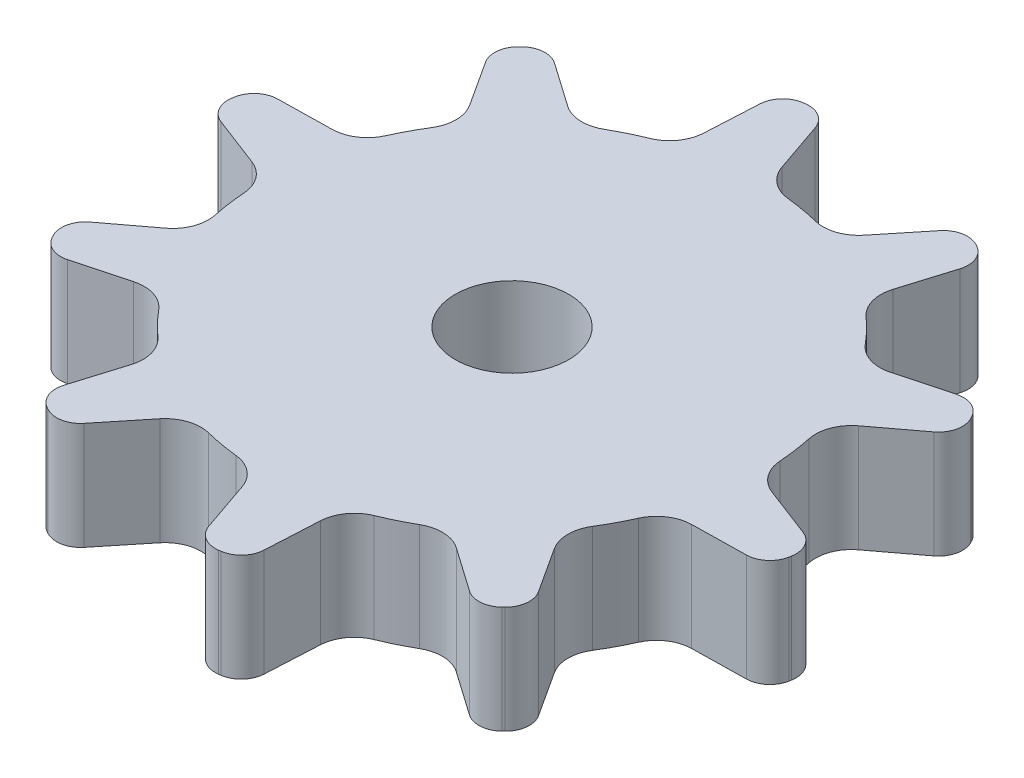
ISO-10303-21;
HEADER;
FILE_DESCRIPTION(('STEP AP214'),'2;1');
FILE_NAME('part.step','',(''),(''),'','','');
FILE_SCHEMA(('AUTOMOTIVE_DESIGN { 1 0 10303 214 1 1 1 1 }'));
ENDSEC;
DATA;
#1=APPLICATION_CONTEXT('core data for automotive mechanical design processes');
#2=APPLICATION_PROTOCOL_DEFINITION('international standard','automotive_design',2000,#1);
#3=PRODUCT_CONTEXT('',#1,'mechanical');
#4=PRODUCT('Part','Part','',(#3));
#5=PRODUCT_RELATED_PRODUCT_CATEGORY('part','',(#4));
#6=PRODUCT_DEFINITION_FORMATION('','',#4);
#7=PRODUCT_DEFINITION_CONTEXT('part definition',#1,'design');
#8=PRODUCT_DEFINITION('design','',#6,#7);
#9=PRODUCT_DEFINITION_SHAPE('','',#8);
#10=(LENGTH_UNIT() NAMED_UNIT(*) SI_UNIT(.MILLI.,.METRE.));
#11=(NAMED_UNIT(*) PLANE_ANGLE_UNIT() SI_UNIT($,.RADIAN.));
#12=(NAMED_UNIT(*) SI_UNIT($,.STERADIAN.) SOLID_ANGLE_UNIT());
#13=UNCERTAINTY_MEASURE_WITH_UNIT(LENGTH_MEASURE(1.E-05),#10,'distance_accuracy_value','');
#14=(GEOMETRIC_REPRESENTATION_CONTEXT(3) GLOBAL_UNCERTAINTY_ASSIGNED_CONTEXT((#13)) GLOBAL_UNIT_ASSIGNED_CONTEXT((#10,
#11,#12)) REPRESENTATION_CONTEXT('',''));
#15=CARTESIAN_POINT('',(0.,0.,0.));
#16=DIRECTION('',(0.,0.,1.));
#17=DIRECTION('',(1.,0.,0.));
#18=AXIS2_PLACEMENT_3D('',#15,#16,#17);
#19=CARTESIAN_POINT('',(-56.2916512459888,9.,32.4999999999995));
#20=DIRECTION('',(0.,-1.,0.));
#21=DIRECTION('',(-0.898794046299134,0.,0.438371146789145));
#22=AXIS2_PLACEMENT_3D('',#19,#20,#21);
#23=CYLINDRICAL_SURFACE('',#22,28.75);
#24=CARTESIAN_POINT('',(-56.2916512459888,0.,32.4999999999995));
#25=DIRECTION('',(0.,1.,0.));
#26=DIRECTION('',(0.898794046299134,0.,-0.438371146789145));
#27=AXIS2_PLACEMENT_3D('',#24,#25,#26);
#28=CIRCLE('',#27,28.75);
#29=CARTESIAN_POINT('',(-36.381984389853,0.,53.2404837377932));
#30=VERTEX_POINT('',#29);
#31=CARTESIAN_POINT('',(-36.2586394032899,0.,53.1213708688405));
#32=VERTEX_POINT('',#31);
#33=EDGE_CURVE('E1135',#30,#32,#28,.T.);
#34=ORIENTED_EDGE('',*,*,#33,.T.);
#35=DIRECTION('',(0.,-1.,0.));
#36=VECTOR('',#35,1.);
#37=CARTESIAN_POINT('',(-36.2586394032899,9.,53.1213708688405));
#38=LINE('',#37,#36);
#39=CARTESIAN_POINT('',(-36.2586394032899,9.,53.1213708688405));
#40=VERTEX_POINT('',#39);
#41=EDGE_CURVE('E1004',#32,#40,#38,.F.);
#42=ORIENTED_EDGE('',*,*,#41,.T.);
#43=CARTESIAN_POINT('',(-56.2916512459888,9.,32.4999999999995));
#44=DIRECTION('',(0.,1.,0.));
#45=DIRECTION('',(0.898794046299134,0.,-0.438371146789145));
#46=AXIS2_PLACEMENT_3D('',#43,#44,#45);
#47=CIRCLE('',#46,28.75);
#48=CARTESIAN_POINT('',(-36.381984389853,9.,53.2404837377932));
#49=VERTEX_POINT('',#48);
#50=EDGE_CURVE('E1354',#49,#40,#47,.T.);
#51=ORIENTED_EDGE('',*,*,#50,.F.);
#52=DIRECTION('',(0.,-1.,0.));
#53=VECTOR('',#52,1.);
#54=CARTESIAN_POINT('',(-36.381984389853,9.,53.2404837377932));
#55=LINE('',#54,#53);
#56=EDGE_CURVE('E1002',#49,#30,#55,.T.);
#57=ORIENTED_EDGE('',*,*,#56,.T.);
#58=EDGE_LOOP('',(#34,#42,#51,#57));
#59=FACE_BOUND('',#58,.T.);
#60=ADVANCED_FACE('F39',(#59),#23,.T.);
#61=CARTESIAN_POINT('',(-27.9934419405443,0.,37.576795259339));
#62=VERTEX_POINT('',#61);
#63=CARTESIAN_POINT('',(-27.9636665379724,0.,37.4079305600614));
#64=VERTEX_POINT('',#63);
#65=EDGE_CURVE('E1140',#62,#64,#28,.T.);
#66=ORIENTED_EDGE('',*,*,#65,.T.);
#67=DIRECTION('',(0.,-1.,0.));
#68=VECTOR('',#67,1.);
#69=CARTESIAN_POINT('',(-27.9636665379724,9.,37.4079305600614));
#70=LINE('',#69,#68);
#71=CARTESIAN_POINT('',(-27.9636665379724,9.,37.4079305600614));
#72=VERTEX_POINT('',#71);
#73=EDGE_CURVE('E986',#64,#72,#70,.F.);
#74=ORIENTED_EDGE('',*,*,#73,.T.);
#75=CARTESIAN_POINT('',(-27.9934419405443,9.,37.576795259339));
#76=VERTEX_POINT('',#75);
#77=EDGE_CURVE('E1355',#76,#72,#47,.T.);
#78=ORIENTED_EDGE('',*,*,#77,.F.);
#79=DIRECTION('',(0.,-1.,0.));
#80=VECTOR('',#79,1.);
#81=CARTESIAN_POINT('',(-27.9934419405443,9.,37.576795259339));
#82=LINE('',#81,#80);
#83=EDGE_CURVE('E984',#76,#62,#82,.T.);
#84=ORIENTED_EDGE('',*,*,#83,.T.);
#85=EDGE_LOOP('',(#66,#74,#78,#84));
#86=FACE_BOUND('',#85,.T.);
#87=ADVANCED_FACE('F1210',(#86),#23,.T.);
#88=CARTESIAN_POINT('',(-52.3753428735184,0.,60.9820123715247));
#89=VERTEX_POINT('',#88);
#90=CARTESIAN_POINT('',(-52.2055418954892,0.,60.9581484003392));
#91=VERTEX_POINT('',#90);
#92=EDGE_CURVE('E1057',#89,#91,#28,.T.);
#93=ORIENTED_EDGE('',*,*,#92,.T.);
#94=DIRECTION('',(0.,-1.,0.));
#95=VECTOR('',#94,1.);
#96=CARTESIAN_POINT('',(-52.2055418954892,9.,60.9581484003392));
#97=LINE('',#96,#95);
#98=CARTESIAN_POINT('',(-52.2055418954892,9.,60.9581484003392));
#99=VERTEX_POINT('',#98);
#100=EDGE_CURVE('E1022',#91,#99,#97,.F.);
#101=ORIENTED_EDGE('',*,*,#100,.T.);
#102=CARTESIAN_POINT('',(-52.3753428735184,9.,60.9820123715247));
#103=VERTEX_POINT('',#102);
#104=EDGE_CURVE('E1199',#103,#99,#47,.T.);
#105=ORIENTED_EDGE('',*,*,#104,.F.);
#106=DIRECTION('',(0.,-1.,0.));
#107=VECTOR('',#106,1.);
#108=CARTESIAN_POINT('',(-52.3753428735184,9.,60.9820123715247));
#109=LINE('',#108,#107);
#110=EDGE_CURVE('E1020',#103,#89,#109,.T.);
#111=ORIENTED_EDGE('',*,*,#110,.T.);
#112=EDGE_LOOP('',(#93,#101,#105,#111));
#113=FACE_BOUND('',#112,.T.);
#114=ADVANCED_FACE('F1215',(#113),#23,.T.);
#115=CARTESIAN_POINT('',(-60.2079596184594,0.,4.01798762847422));
#116=VERTEX_POINT('',#115);
#117=CARTESIAN_POINT('',(-60.3777605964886,0.,4.04185159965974));
#118=VERTEX_POINT('',#117);
#119=EDGE_CURVE('E1153',#116,#118,#28,.T.);
#120=ORIENTED_EDGE('',*,*,#119,.T.);
#121=DIRECTION('',(0.,-1.,0.));
#122=VECTOR('',#121,1.);
#123=CARTESIAN_POINT('',(-60.3777605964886,9.,4.04185159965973));
#124=LINE('',#123,#122);
#125=CARTESIAN_POINT('',(-60.3777605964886,9.,4.04185159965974));
#126=VERTEX_POINT('',#125);
#127=EDGE_CURVE('E932',#118,#126,#124,.F.);
#128=ORIENTED_EDGE('',*,*,#127,.T.);
#129=CARTESIAN_POINT('',(-60.2079596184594,9.,4.01798762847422));
#130=VERTEX_POINT('',#129);
#131=EDGE_CURVE('E1363',#130,#126,#47,.T.);
#132=ORIENTED_EDGE('',*,*,#131,.F.);
#133=DIRECTION('',(0.,-1.,0.));
#134=VECTOR('',#133,1.);
#135=CARTESIAN_POINT('',(-60.2079596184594,9.,4.01798762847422));
#136=LINE('',#135,#134);
#137=EDGE_CURVE('E930',#130,#116,#136,.T.);
#138=ORIENTED_EDGE('',*,*,#137,.T.);
#139=EDGE_LOOP('',(#120,#128,#132,#138));
#140=FACE_BOUND('',#139,.T.);
#141=ADVANCED_FACE('F1397',(#140),#23,.T.);
#142=CARTESIAN_POINT('',(-76.2013181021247,0.,11.7595162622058));
#143=VERTEX_POINT('',#142);
#144=CARTESIAN_POINT('',(-76.3246630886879,0.,11.8786291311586));
#145=VERTEX_POINT('',#144);
#146=EDGE_CURVE('E874',#143,#145,#28,.T.);
#147=ORIENTED_EDGE('',*,*,#146,.T.);
#148=DIRECTION('',(0.,-1.,0.));
#149=VECTOR('',#148,1.);
#150=CARTESIAN_POINT('',(-76.3246630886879,9.,11.8786291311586));
#151=LINE('',#150,#149);
#152=CARTESIAN_POINT('',(-76.3246630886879,9.,11.8786291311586));
#153=VERTEX_POINT('',#152);
#154=EDGE_CURVE('E914',#145,#153,#151,.F.);
#155=ORIENTED_EDGE('',*,*,#154,.T.);
#156=CARTESIAN_POINT('',(-76.2013181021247,9.,11.7595162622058));
#157=VERTEX_POINT('',#156);
#158=EDGE_CURVE('E868',#157,#153,#47,.T.);
#159=ORIENTED_EDGE('',*,*,#158,.F.);
#160=DIRECTION('',(0.,-1.,0.));
#161=VECTOR('',#160,1.);
#162=CARTESIAN_POINT('',(-76.2013181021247,9.,11.7595162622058));
#163=LINE('',#162,#161);
#164=EDGE_CURVE('E912',#157,#143,#163,.T.);
#165=ORIENTED_EDGE('',*,*,#164,.T.);
#166=EDGE_LOOP('',(#147,#155,#159,#165));
#167=FACE_BOUND('',#166,.T.);
#168=ADVANCED_FACE('F1372',(#167),#23,.T.);
#169=CARTESIAN_POINT('',(-30.4138536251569,0.,19.9739435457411));
#170=VERTEX_POINT('',#169);
#171=CARTESIAN_POINT('',(-30.4890209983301,0.,19.8198275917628));
#172=VERTEX_POINT('',#171);
#173=EDGE_CURVE('E1143',#170,#172,#28,.T.);
#174=ORIENTED_EDGE('',*,*,#173,.T.);
#175=DIRECTION('',(0.,-1.,0.));
#176=VECTOR('',#175,1.);
#177=CARTESIAN_POINT('',(-30.4890209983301,9.,19.8198275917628));
#178=LINE('',#177,#176);
#179=CARTESIAN_POINT('',(-30.4890209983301,9.,19.8198275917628));
#180=VERTEX_POINT('',#179);
#181=EDGE_CURVE('E968',#172,#180,#178,.F.);
#182=ORIENTED_EDGE('',*,*,#181,.T.);
#183=CARTESIAN_POINT('',(-30.4138536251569,9.,19.9739435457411));
#184=VERTEX_POINT('',#183);
#185=EDGE_CURVE('E1357',#184,#180,#47,.T.);
#186=ORIENTED_EDGE('',*,*,#185,.F.);
#187=DIRECTION('',(0.,-1.,0.));
#188=VECTOR('',#187,1.);
#189=CARTESIAN_POINT('',(-30.4138536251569,9.,19.9739435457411));
#190=LINE('',#189,#188);
#191=EDGE_CURVE('E966',#184,#170,#190,.T.);
#192=ORIENTED_EDGE('',*,*,#191,.T.);
#193=EDGE_LOOP('',(#174,#182,#186,#192));
#194=FACE_BOUND('',#193,.T.);
#195=ADVANCED_FACE('F1234',(#194),#23,.T.);
#196=CARTESIAN_POINT('',(-42.7187044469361,0.,7.1556196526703));
#197=VERTEX_POINT('',#196);
#198=CARTESIAN_POINT('',(-42.8701032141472,0.,7.07511950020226));
#199=VERTEX_POINT('',#198);
#200=EDGE_CURVE('E1148',#197,#199,#28,.T.);
#201=ORIENTED_EDGE('',*,*,#200,.T.);
#202=DIRECTION('',(0.,-1.,0.));
#203=VECTOR('',#202,1.);
#204=CARTESIAN_POINT('',(-42.8701032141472,9.,7.07511950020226));
#205=LINE('',#204,#203);
#206=CARTESIAN_POINT('',(-42.8701032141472,9.,7.07511950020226));
#207=VERTEX_POINT('',#206);
#208=EDGE_CURVE('E950',#199,#207,#205,.F.);
#209=ORIENTED_EDGE('',*,*,#208,.T.);
#210=CARTESIAN_POINT('',(-42.7187044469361,9.,7.1556196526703));
#211=VERTEX_POINT('',#210);
#212=EDGE_CURVE('E1360',#211,#207,#47,.T.);
#213=ORIENTED_EDGE('',*,*,#212,.F.);
#214=DIRECTION('',(0.,-1.,0.));
#215=VECTOR('',#214,1.);
#216=CARTESIAN_POINT('',(-42.7187044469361,9.,7.1556196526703));
#217=LINE('',#216,#215);
#218=EDGE_CURVE('E948',#211,#197,#217,.T.);
#219=ORIENTED_EDGE('',*,*,#218,.T.);
#220=EDGE_LOOP('',(#201,#209,#213,#219));
#221=FACE_BOUND('',#220,.T.);
#222=ADVANCED_FACE('F1229',(#221),#23,.T.);
#223=CARTESIAN_POINT('',(-84.5898605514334,0.,27.4232047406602));
#224=VERTEX_POINT('',#223);
#225=CARTESIAN_POINT('',(-84.6196359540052,0.,27.5920694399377));
#226=VERTEX_POINT('',#225);
#227=EDGE_CURVE('E843',#224,#226,#28,.T.);
#228=ORIENTED_EDGE('',*,*,#227,.T.);
#229=DIRECTION('',(0.,-1.,0.));
#230=VECTOR('',#229,1.);
#231=CARTESIAN_POINT('',(-84.6196359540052,9.,27.5920694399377));
#232=LINE('',#231,#230);
#233=CARTESIAN_POINT('',(-84.6196359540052,9.,27.5920694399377));
#234=VERTEX_POINT('',#233);
#235=EDGE_CURVE('E896',#226,#234,#232,.F.);
#236=ORIENTED_EDGE('',*,*,#235,.T.);
#237=CARTESIAN_POINT('',(-84.5898605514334,9.,27.4232047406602));
#238=VERTEX_POINT('',#237);
#239=EDGE_CURVE('E865',#238,#234,#47,.T.);
#240=ORIENTED_EDGE('',*,*,#239,.F.);
#241=DIRECTION('',(0.,-1.,0.));
#242=VECTOR('',#241,1.);
#243=CARTESIAN_POINT('',(-84.5898605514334,9.,27.4232047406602));
#244=LINE('',#243,#242);
#245=EDGE_CURVE('E894',#238,#224,#244,.T.);
#246=ORIENTED_EDGE('',*,*,#245,.T.);
#247=EDGE_LOOP('',(#228,#236,#240,#246));
#248=FACE_BOUND('',#247,.T.);
#249=ADVANCED_FACE('F1225',(#248),#23,.T.);
#250=CARTESIAN_POINT('',(-82.1694488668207,0.,45.0260564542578));
#251=VERTEX_POINT('',#250);
#252=CARTESIAN_POINT('',(-82.0942814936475,0.,45.1801724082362));
#253=VERTEX_POINT('',#252);
#254=EDGE_CURVE('E869',#251,#253,#28,.T.);
#255=ORIENTED_EDGE('',*,*,#254,.T.);
#256=DIRECTION('',(0.,-1.,0.));
#257=VECTOR('',#256,1.);
#258=CARTESIAN_POINT('',(-82.0942814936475,9.,45.1801724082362));
#259=LINE('',#258,#257);
#260=CARTESIAN_POINT('',(-82.0942814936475,9.,45.1801724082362));
#261=VERTEX_POINT('',#260);
#262=EDGE_CURVE('E878',#253,#261,#259,.F.);
#263=ORIENTED_EDGE('',*,*,#262,.T.);
#264=CARTESIAN_POINT('',(-82.1694488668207,9.,45.0260564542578));
#265=VERTEX_POINT('',#264);
#266=EDGE_CURVE('E871',#265,#261,#47,.T.);
#267=ORIENTED_EDGE('',*,*,#266,.F.);
#268=DIRECTION('',(0.,-1.,0.));
#269=VECTOR('',#268,1.);
#270=CARTESIAN_POINT('',(-82.1694488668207,9.,45.0260564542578));
#271=LINE('',#270,#269);
#272=EDGE_CURVE('E876',#265,#251,#271,.T.);
#273=ORIENTED_EDGE('',*,*,#272,.T.);
#274=EDGE_LOOP('',(#255,#263,#267,#273));
#275=FACE_BOUND('',#274,.T.);
#276=ADVANCED_FACE('F1169',(#275),#23,.T.);
#277=CARTESIAN_POINT('',(-69.8645980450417,0.,57.8443803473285));
#278=VERTEX_POINT('',#277);
#279=CARTESIAN_POINT('',(-69.7131992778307,0.,57.9248804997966));
#280=VERTEX_POINT('',#279);
#281=EDGE_CURVE('E875',#278,#280,#28,.T.);
#282=ORIENTED_EDGE('',*,*,#281,.T.);
#283=DIRECTION('',(0.,-1.,0.));
#284=VECTOR('',#283,1.);
#285=CARTESIAN_POINT('',(-69.7131992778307,9.,57.9248804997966));
#286=LINE('',#285,#284);
#287=CARTESIAN_POINT('',(-69.7131992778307,9.,57.9248804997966));
#288=VERTEX_POINT('',#287);
#289=EDGE_CURVE('E1040',#280,#288,#286,.F.);
#290=ORIENTED_EDGE('',*,*,#289,.T.);
#291=CARTESIAN_POINT('',(-69.8645980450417,9.,57.8443803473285));
#292=VERTEX_POINT('',#291);
#293=EDGE_CURVE('E870',#292,#288,#47,.T.);
#294=ORIENTED_EDGE('',*,*,#293,.F.);
#295=DIRECTION('',(0.,-1.,0.));
#296=VECTOR('',#295,1.);
#297=CARTESIAN_POINT('',(-69.8645980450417,9.,57.8443803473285));
#298=LINE('',#297,#296);
#299=EDGE_CURVE('E1038',#292,#278,#298,.T.);
#300=ORIENTED_EDGE('',*,*,#299,.T.);
#301=EDGE_LOOP('',(#282,#290,#294,#300));
#302=FACE_BOUND('',#301,.T.);
#303=ADVANCED_FACE('F1053',(#302),#23,.T.);
#304=CARTESIAN_POINT('',(2.12996176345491,9.,4.00587545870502));
#305=DIRECTION('',(0.,1.,0.));
#306=DIRECTION('',(0.898794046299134,0.,-0.438371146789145));
#307=AXIS2_PLACEMENT_3D('',#304,#305,#306);
#308=PLANE('',#307);
#309=CARTESIAN_POINT('',(-56.2916512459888,9.,32.4999999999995));
#310=DIRECTION('',(0.,1.,0.));
#311=DIRECTION('',(0.898794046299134,0.,-0.438371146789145));
#312=AXIS2_PLACEMENT_3D('',#309,#310,#311);
#313=CIRCLE('',#312,4.75);
#314=CARTESIAN_POINT('',(-52.0223795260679,9.,30.417737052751));
#315=VERTEX_POINT('',#314);
#316=EDGE_CURVE('E1571',#315,#315,#313,.T.);
#317=ORIENTED_EDGE('',*,*,#316,.F.);
#318=EDGE_LOOP('',(#317));
#319=FACE_BOUND('',#318,.T.);
#320=ORIENTED_EDGE('',*,*,#293,.T.);
#321=CARTESIAN_POINT('',(-68.7795263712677,9.,56.1561931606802));
#322=DIRECTION('',(0.,1.,0.));
#323=DIRECTION('',(0.898794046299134,0.,-0.438371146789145));
#324=AXIS2_PLACEMENT_3D('',#321,#322,#323);
#325=CIRCLE('',#324,2.);
#326=CARTESIAN_POINT('',(-67.2252344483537,9.,57.4148339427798));
#327=VERTEX_POINT('',#326);
#328=EDGE_CURVE('E1045',#288,#327,#325,.T.);
#329=ORIENTED_EDGE('',*,*,#328,.T.);
#330=DIRECTION('',(-0.629320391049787,0.,0.777145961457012));
#331=VECTOR('',#330,1.);
#332=CARTESIAN_POINT('',(-68.229119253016,9.,58.6545284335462));
#333=LINE('',#332,#331);
#334=CARTESIAN_POINT('',(-64.3868074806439,9.,53.9096685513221));
#335=VERTEX_POINT('',#334);
#336=EDGE_CURVE('E556',#335,#327,#333,.T.);
#337=ORIENTED_EDGE('',*,*,#336,.F.);
#338=CARTESIAN_POINT('',(-62.0553695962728,9.,55.7976297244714));
#339=DIRECTION('',(0.,1.,0.));
#340=DIRECTION('',(-0.469471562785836,0.,0.882947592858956));
#341=AXIS2_PLACEMENT_3D('',#338,#339,#340);
#342=CIRCLE('',#341,3.);
#343=CARTESIAN_POINT('',(-61.3349048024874,9.,52.8854260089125));
#344=VERTEX_POINT('',#343);
#345=EDGE_CURVE('E1063',#344,#335,#342,.T.);
#346=ORIENTED_EDGE('',*,*,#345,.F.);
#347=CARTESIAN_POINT('',(-56.2916512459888,9.,32.4999999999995));
#348=DIRECTION('',(0.,-1.,0.));
#349=DIRECTION('',(-0.139173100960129,0.,-0.990268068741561));
#350=AXIS2_PLACEMENT_3D('',#347,#348,#349);
#351=CIRCLE('',#350,21.);
#352=CARTESIAN_POINT('',(-58.5247694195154,9.,53.3809286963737));
#353=VERTEX_POINT('',#352);
#354=EDGE_CURVE('E545',#353,#344,#351,.T.);
#355=ORIENTED_EDGE('',*,*,#354,.F.);
#356=CARTESIAN_POINT('',(-58.8437863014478,9.,56.3639185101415));
#357=DIRECTION('',(0.,1.,0.));
#358=DIRECTION('',(-0.139173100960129,0.,-0.990268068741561));
#359=AXIS2_PLACEMENT_3D('',#356,#357,#358);
#360=CIRCLE('',#359,3.);
#361=CARTESIAN_POINT('',(-56.0072305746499,9.,55.3872140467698));
#362=VERTEX_POINT('',#361);
#363=EDGE_CURVE('E569',#362,#353,#360,.T.);
#364=ORIENTED_EDGE('',*,*,#363,.F.);
#365=DIRECTION('',(-0.325568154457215,0.,-0.945518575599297));
#366=VECTOR('',#365,1.);
#367=CARTESIAN_POINT('',(-54.0194762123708,9.,61.1600718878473));
#368=LINE('',#367,#366);
#369=CARTESIAN_POINT('',(-54.5388188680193,9.,59.6517912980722));
#370=VERTEX_POINT('',#369);
#371=EDGE_CURVE('E565',#370,#362,#368,.T.);
#372=ORIENTED_EDGE('',*,*,#371,.F.);
#373=CARTESIAN_POINT('',(-52.6477817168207,9.,59.0006549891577));
#374=DIRECTION('',(0.,1.,0.));
#375=DIRECTION('',(0.898794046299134,0.,-0.438371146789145));
#376=AXIS2_PLACEMENT_3D('',#373,#374,#375);
#377=CIRCLE('',#376,2.);
#378=EDGE_CURVE('E1025',#370,#103,#377,.T.);
#379=ORIENTED_EDGE('',*,*,#378,.T.);
#380=ORIENTED_EDGE('',*,*,#104,.T.);
#381=CARTESIAN_POINT('',(-52.4897929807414,9.,58.9784511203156));
#382=DIRECTION('',(0.,1.,0.));
#383=DIRECTION('',(0.898794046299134,0.,-0.438371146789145));
#384=AXIS2_PLACEMENT_3D('',#381,#382,#383);
#385=CIRCLE('',#384,2.);
#386=CARTESIAN_POINT('',(-50.4925339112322,9.,59.0831230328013));
#387=VERTEX_POINT('',#386);
#388=EDGE_CURVE('E1027',#99,#387,#385,.T.);
#389=ORIENTED_EDGE('',*,*,#388,.T.);
#390=DIRECTION('',(-0.0523359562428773,0.,0.998629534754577));
#391=VECTOR('',#390,1.);
#392=CARTESIAN_POINT('',(-50.5760196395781,9.,60.6761256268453));
#393=LINE('',#392,#391);
#394=CARTESIAN_POINT('',(-50.2564827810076,9.,54.578999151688));
#395=VERTEX_POINT('',#394);
#396=EDGE_CURVE('E1075',#395,#387,#393,.T.);
#397=ORIENTED_EDGE('',*,*,#396,.F.);
#398=CARTESIAN_POINT('',(-47.2605941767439,9.,54.7360070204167));
#399=DIRECTION('',(0.,1.,0.));
#400=DIRECTION('',(0.139173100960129,0.,0.990268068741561));
#401=AXIS2_PLACEMENT_3D('',#398,#399,#400);
#402=CIRCLE('',#401,3.);
#403=CARTESIAN_POINT('',(-48.3894763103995,9.,51.9565061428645));
#404=VERTEX_POINT('',#403);
#405=EDGE_CURVE('E1079',#404,#395,#402,.T.);
#406=ORIENTED_EDGE('',*,*,#405,.F.);
#407=CARTESIAN_POINT('',(-56.2916512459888,9.,32.4999999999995));
#408=DIRECTION('',(0.,-1.,0.));
#409=DIRECTION('',(-0.694658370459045,0.,-0.719339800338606));
#410=AXIS2_PLACEMENT_3D('',#407,#408,#409);
#411=CIRCLE('',#410,21.);
#412=CARTESIAN_POINT('',(-45.8247798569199,9.,50.705620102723));
#413=VERTEX_POINT('',#412);
#414=EDGE_CURVE('E612',#413,#404,#411,.T.);
#415=ORIENTED_EDGE('',*,*,#414,.F.);
#416=CARTESIAN_POINT('',(-44.3295125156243,9.,53.3064229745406));
#417=DIRECTION('',(0.,1.,0.));
#418=DIRECTION('',(-0.694658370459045,0.,-0.719339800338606));
#419=AXIS2_PLACEMENT_3D('',#416,#417,#418);
#420=CIRCLE('',#419,3.);
#421=CARTESIAN_POINT('',(-42.6087832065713,9.,50.8489668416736));
#422=VERTEX_POINT('',#421);
#423=EDGE_CURVE('E609',#422,#413,#420,.T.);
#424=ORIENTED_EDGE('',*,*,#423,.F.);
#425=DIRECTION('',(-0.819152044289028,0.,-0.573576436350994));
#426=VECTOR('',#425,1.);
#427=CARTESIAN_POINT('',(-37.6074554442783,9.,54.3509342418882));
#428=LINE('',#427,#426);
#429=CARTESIAN_POINT('',(-38.9141575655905,9.,53.4359715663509));
#430=VERTEX_POINT('',#429);
#431=EDGE_CURVE('E603',#430,#422,#428,.T.);
#432=ORIENTED_EDGE('',*,*,#431,.F.);
#433=CARTESIAN_POINT('',(-37.7670046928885,9.,51.7976674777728));
#434=DIRECTION('',(0.,1.,0.));
#435=DIRECTION('',(0.898794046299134,0.,-0.438371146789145));
#436=AXIS2_PLACEMENT_3D('',#433,#434,#435);
#437=CIRCLE('',#436,2.);
#438=EDGE_CURVE('E1007',#430,#49,#437,.T.);
#439=ORIENTED_EDGE('',*,*,#438,.T.);
#440=ORIENTED_EDGE('',*,*,#50,.T.);
#441=CARTESIAN_POINT('',(-37.6522402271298,9.,51.6868407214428));
#442=DIRECTION('',(0.,1.,0.));
#443=DIRECTION('',(0.898794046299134,0.,-0.438371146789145));
#444=AXIS2_PLACEMENT_3D('',#441,#442,#443);
#445=CIRCLE('',#444,2.);
#446=CARTESIAN_POINT('',(-35.974899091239,9.,50.5975626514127));
#447=VERTEX_POINT('',#446);
#448=EDGE_CURVE('E1009',#40,#447,#445,.T.);
#449=ORIENTED_EDGE('',*,*,#448,.T.);
#450=DIRECTION('',(0.544639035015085,0.,0.838670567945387));
#451=VECTOR('',#450,1.);
#452=CARTESIAN_POINT('',(-35.1060970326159,9.,51.9354005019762));
#453=LINE('',#452,#451);
#454=CARTESIAN_POINT('',(-38.4313873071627,9.,46.814902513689));
#455=VERTEX_POINT('',#454);
#456=EDGE_CURVE('E1106',#455,#447,#453,.T.);
#457=ORIENTED_EDGE('',*,*,#456,.F.);
#458=CARTESIAN_POINT('',(-35.9153756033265,9.,45.1809854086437));
#459=DIRECTION('',(0.,1.,0.));
#460=DIRECTION('',(0.694658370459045,0.,0.719339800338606));
#461=AXIS2_PLACEMENT_3D('',#458,#459,#460);
#462=CIRCLE('',#461,3.);
#463=CARTESIAN_POINT('',(-38.4624100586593,9.,43.5958622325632));
#464=VERTEX_POINT('',#463);
#465=EDGE_CURVE('E578',#464,#455,#462,.T.);
#466=ORIENTED_EDGE('',*,*,#465,.F.);
#467=CARTESIAN_POINT('',(-56.2916512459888,9.,32.4999999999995));
#468=DIRECTION('',(0.,-1.,0.));
#469=DIRECTION('',(-0.98480775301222,0.,-0.173648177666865));
#470=AXIS2_PLACEMENT_3D('',#467,#468,#469);
#471=CIRCLE('',#470,21.);
#472=CARTESIAN_POINT('',(-37.1227794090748,9.,41.0763834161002));
#473=VERTEX_POINT('',#472);
#474=EDGE_CURVE('E650',#473,#464,#471,.T.);
#475=ORIENTED_EDGE('',*,*,#474,.F.);
#476=CARTESIAN_POINT('',(-34.3843691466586,9.,42.3015810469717));
#477=DIRECTION('',(0.,1.,0.));
#478=DIRECTION('',(-0.98480775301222,0.,-0.173648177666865));
#479=AXIS2_PLACEMENT_3D('',#476,#477,#478);
#480=CIRCLE('',#479,3.);
#481=CARTESIAN_POINT('',(-34.4367263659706,9.,39.3020379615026));
#482=VERTEX_POINT('',#481);
#483=EDGE_CURVE('E596',#482,#473,#480,.T.);
#484=ORIENTED_EDGE('',*,*,#483,.F.);
#485=DIRECTION('',(-0.99984769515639,0.,0.0174524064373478));
#486=VECTOR('',#485,1.);
#487=CARTESIAN_POINT('',(-28.3321624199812,9.,39.1954824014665));
#488=LINE('',#487,#486);
#489=CARTESIAN_POINT('',(-29.9271082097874,9.,39.2233222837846));
#490=VERTEX_POINT('',#489);
#491=EDGE_CURVE('E642',#490,#482,#488,.T.);
#492=ORIENTED_EDGE('',*,*,#491,.F.);
#493=CARTESIAN_POINT('',(-29.9620130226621,9.,37.2236268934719));
#494=DIRECTION('',(0.,1.,0.));
#495=DIRECTION('',(0.898794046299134,0.,-0.438371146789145));
#496=AXIS2_PLACEMENT_3D('',#493,#494,#495);
#497=CIRCLE('',#496,2.);
#498=EDGE_CURVE('E989',#490,#76,#497,.T.);
#499=ORIENTED_EDGE('',*,*,#498,.T.);
#500=ORIENTED_EDGE('',*,*,#77,.T.);
#501=CARTESIAN_POINT('',(-29.9343089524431,9.,37.0665093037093));
#502=DIRECTION('',(0.,1.,0.));
#503=DIRECTION('',(0.898794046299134,0.,-0.438371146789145));
#504=AXIS2_PLACEMENT_3D('',#501,#502,#503);
#505=CIRCLE('',#504,2.);
#506=CARTESIAN_POINT('',(-29.2175730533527,9.,35.1993484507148));
#507=VERTEX_POINT('',#506);
#508=EDGE_CURVE('E991',#72,#507,#505,.T.);
#509=ORIENTED_EDGE('',*,*,#508,.T.);
#510=DIRECTION('',(0.933580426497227,0.,0.358367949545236));
#511=VECTOR('',#510,1.);
#512=CARTESIAN_POINT('',(-27.7283360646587,9.,35.7710129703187));
#513=LINE('',#512,#511);
#514=CARTESIAN_POINT('',(-33.4283056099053,9.,33.5829996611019));
#515=VERTEX_POINT('',#514);
#516=EDGE_CURVE('E584',#515,#507,#513,.T.);
#517=ORIENTED_EDGE('',*,*,#516,.F.);
#518=CARTESIAN_POINT('',(-32.3532017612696,9.,30.7822583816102));
#519=DIRECTION('',(0.,1.,0.));
#520=DIRECTION('',(0.98480775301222,0.,0.173648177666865));
#521=AXIS2_PLACEMENT_3D('',#518,#519,#520);
#522=CIRCLE('',#521,3.);
#523=CARTESIAN_POINT('',(-35.3455079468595,9.,30.9969760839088));
#524=VERTEX_POINT('',#523);
#525=EDGE_CURVE('E588',#524,#515,#522,.T.);
#526=ORIENTED_EDGE('',*,*,#525,.F.);
#527=CARTESIAN_POINT('',(-56.2916512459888,9.,32.4999999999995));
#528=DIRECTION('',(0.,-1.,0.));
#529=DIRECTION('',(-0.898794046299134,0.,0.438371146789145));
#530=AXIS2_PLACEMENT_3D('',#527,#528,#529);
#531=CIRCLE('',#530,21.);
#532=CARTESIAN_POINT('',(-35.7426364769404,9.,28.1712597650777));
#533=VERTEX_POINT('',#532);
#534=EDGE_CURVE('E687',#533,#524,#531,.T.);
#535=ORIENTED_EDGE('',*,*,#534,.F.);
#536=CARTESIAN_POINT('',(-32.8070629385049,9.,27.552868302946));
#537=DIRECTION('',(0.,1.,0.));
#538=DIRECTION('',(-0.898794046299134,0.,0.438371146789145));
#539=AXIS2_PLACEMENT_3D('',#536,#537,#538);
#540=CIRCLE('',#539,3.);
#541=CARTESIAN_POINT('',(-34.6125080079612,9.,25.1569617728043));
#542=VERTEX_POINT('',#541);
#543=EDGE_CURVE('E635',#542,#533,#540,.T.);
#544=ORIENTED_EDGE('',*,*,#543,.F.);
#545=DIRECTION('',(-0.798635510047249,0.,0.601815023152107));
#546=VECTOR('',#545,1.);
#547=CARTESIAN_POINT('',(-29.7364438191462,9.,21.482583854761));
#548=LINE('',#547,#546);
#549=CARTESIAN_POINT('',(-31.010418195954,9.,22.4425924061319));
#550=VERTEX_POINT('',#549);
#551=EDGE_CURVE('E679',#550,#542,#548,.T.);
#552=ORIENTED_EDGE('',*,*,#551,.F.);
#553=CARTESIAN_POINT('',(-32.2140482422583,9.,20.8453213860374));
#554=DIRECTION('',(0.,1.,0.));
#555=DIRECTION('',(0.898794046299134,0.,-0.438371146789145));
#556=AXIS2_PLACEMENT_3D('',#553,#554,#555);
#557=CIRCLE('',#556,2.);
#558=EDGE_CURVE('E971',#550,#184,#557,.T.);
#559=ORIENTED_EDGE('',*,*,#558,.T.);
#560=ORIENTED_EDGE('',*,*,#185,.T.);
#561=CARTESIAN_POINT('',(-32.2839865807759,9.,20.701926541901));
#562=DIRECTION('',(0.,1.,0.));
#563=DIRECTION('',(0.898794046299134,0.,-0.438371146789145));
#564=AXIS2_PLACEMENT_3D('',#561,#562,#563);
#565=CIRCLE('',#564,2.);
#566=CARTESIAN_POINT('',(-32.8016246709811,9.,18.7700748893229));
#567=VERTEX_POINT('',#566);
#568=EDGE_CURVE('E973',#180,#567,#565,.T.);
#569=ORIENTED_EDGE('',*,*,#568,.T.);
#570=DIRECTION('',(0.965925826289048,0.,-0.258819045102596));
#571=VECTOR('',#570,1.);
#572=CARTESIAN_POINT('',(-31.2607906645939,9.,18.3572096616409));
#573=LINE('',#572,#571);
#574=CARTESIAN_POINT('',(-37.1582448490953,9.,19.9374277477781));
#575=VERTEX_POINT('',#574);
#576=EDGE_CURVE('E623',#575,#567,#573,.T.);
#577=ORIENTED_EDGE('',*,*,#576,.F.);
#578=CARTESIAN_POINT('',(-37.9347019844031,9.,17.0396502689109));
#579=DIRECTION('',(0.,1.,0.));
#580=DIRECTION('',(0.898794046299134,0.,-0.438371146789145));
#581=AXIS2_PLACEMENT_3D('',#578,#579,#580);
#582=CIRCLE('',#581,3.);
#583=CARTESIAN_POINT('',(-40.2293206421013,9.,18.972193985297));
#584=VERTEX_POINT('',#583);
#585=EDGE_CURVE('E627',#584,#575,#582,.T.);
#586=ORIENTED_EDGE('',*,*,#585,.F.);
#587=CARTESIAN_POINT('',(-56.2916512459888,9.,32.4999999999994));
#588=DIRECTION('',(0.,-1.,0.));
#589=DIRECTION('',(-0.469471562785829,0.,0.88294759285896));
#590=AXIS2_PLACEMENT_3D('',#587,#588,#589);
#591=CIRCLE('',#590,21.);
#592=CARTESIAN_POINT('',(-42.2115187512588,9.,16.9195677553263));
#593=VERTEX_POINT('',#592);
#594=EDGE_CURVE('E724',#593,#584,#591,.T.);
#595=ORIENTED_EDGE('',*,*,#594,.F.);
#596=CARTESIAN_POINT('',(-40.2000712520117,9.,14.6937917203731));
#597=DIRECTION('',(0.,1.,0.));
#598=DIRECTION('',(-0.469471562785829,0.,0.88294759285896));
#599=AXIS2_PLACEMENT_3D('',#596,#597,#598);
#600=CIRCLE('',#599,3.);
#601=CARTESIAN_POINT('',(-43.0689855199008,9.,13.816676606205));
#602=VERTEX_POINT('',#601);
#603=EDGE_CURVE('E672',#602,#593,#600,.T.);
#604=ORIENTED_EDGE('',*,*,#603,.F.);
#605=DIRECTION('',(-0.292371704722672,0.,0.956304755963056));
#606=VECTOR('',#605,1.);
#607=CARTESIAN_POINT('',(-41.2839118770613,9.,7.97796380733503));
#608=LINE('',#607,#606);
#609=CARTESIAN_POINT('',(-41.7502999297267,9.,9.5034503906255));
#610=VERTEX_POINT('',#609);
#611=EDGE_CURVE('E716',#610,#602,#608,.T.);
#612=ORIENTED_EDGE('',*,*,#611,.F.);
#613=CARTESIAN_POINT('',(-43.6629094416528,9.,8.91870698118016));
#614=DIRECTION('',(0.,1.,0.));
#615=DIRECTION('',(0.898794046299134,0.,-0.438371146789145));
#616=AXIS2_PLACEMENT_3D('',#613,#614,#615);
#617=CIRCLE('',#616,2.);
#618=EDGE_CURVE('E953',#610,#211,#617,.T.);
#619=ORIENTED_EDGE('',*,*,#618,.T.);
#620=ORIENTED_EDGE('',*,*,#212,.T.);
#621=CARTESIAN_POINT('',(-43.8037761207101,9.,8.84380683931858));
#622=DIRECTION('',(0.,1.,0.));
#623=DIRECTION('',(0.898794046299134,0.,-0.438371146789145));
#624=AXIS2_PLACEMENT_3D('',#621,#622,#623);
#625=CIRCLE('',#624,2.);
#626=CARTESIAN_POINT('',(-45.3580680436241,9.,7.58516605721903));
#627=VERTEX_POINT('',#626);
#628=EDGE_CURVE('E955',#207,#627,#625,.T.);
#629=ORIENTED_EDGE('',*,*,#628,.T.);
#630=DIRECTION('',(0.629320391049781,0.,-0.777145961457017));
#631=VECTOR('',#630,1.);
#632=CARTESIAN_POINT('',(-44.3541832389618,9.,6.34547156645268));
#633=LINE('',#632,#631);
#634=CARTESIAN_POINT('',(-48.1964950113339,9.,11.0903314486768));
#635=VERTEX_POINT('',#634);
#636=EDGE_CURVE('E660',#635,#627,#633,.T.);
#637=ORIENTED_EDGE('',*,*,#636,.F.);
#638=CARTESIAN_POINT('',(-50.5279328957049,9.,9.20237027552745));
#639=DIRECTION('',(0.,1.,0.));
#640=DIRECTION('',(0.469471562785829,0.,-0.88294759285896));
#641=AXIS2_PLACEMENT_3D('',#638,#639,#640);
#642=CIRCLE('',#641,3.);
#643=CARTESIAN_POINT('',(-51.2483976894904,9.,12.1145739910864));
#644=VERTEX_POINT('',#643);
#645=EDGE_CURVE('E664',#644,#635,#642,.T.);
#646=ORIENTED_EDGE('',*,*,#645,.F.);
#647=CARTESIAN_POINT('',(-56.2916512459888,9.,32.4999999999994));
#648=DIRECTION('',(0.,-1.,0.));
#649=DIRECTION('',(0.139173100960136,0.,0.990268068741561));
#650=AXIS2_PLACEMENT_3D('',#647,#648,#649);
#651=CIRCLE('',#650,21.);
#652=CARTESIAN_POINT('',(-54.0585330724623,9.,11.6190713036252));
#653=VERTEX_POINT('',#652);
#654=EDGE_CURVE('E761',#653,#644,#651,.T.);
#655=ORIENTED_EDGE('',*,*,#654,.F.);
#656=CARTESIAN_POINT('',(-53.73951619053,9.,8.63608148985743));
#657=DIRECTION('',(0.,1.,0.));
#658=DIRECTION('',(0.139173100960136,0.,0.990268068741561));
#659=AXIS2_PLACEMENT_3D('',#656,#657,#658);
#660=CIRCLE('',#659,3.);
#661=CARTESIAN_POINT('',(-56.5760719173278,9.,9.6127859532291));
#662=VERTEX_POINT('',#661);
#663=EDGE_CURVE('E709',#662,#653,#660,.T.);
#664=ORIENTED_EDGE('',*,*,#663,.F.);
#665=DIRECTION('',(0.325568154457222,0.,0.945518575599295));
#666=VECTOR('',#665,1.);
#667=CARTESIAN_POINT('',(-58.563826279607,9.,3.8399281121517));
#668=LINE('',#667,#666);
#669=CARTESIAN_POINT('',(-58.0444836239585,9.,5.34820870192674));
#670=VERTEX_POINT('',#669);
#671=EDGE_CURVE('E753',#670,#662,#668,.T.);
#672=ORIENTED_EDGE('',*,*,#671,.F.);
#673=CARTESIAN_POINT('',(-59.9355207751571,9.,5.99934501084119));
#674=DIRECTION('',(0.,1.,0.));
#675=DIRECTION('',(0.898794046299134,0.,-0.438371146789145));
#676=AXIS2_PLACEMENT_3D('',#673,#674,#675);
#677=CIRCLE('',#676,2.);
#678=EDGE_CURVE('E935',#670,#130,#677,.T.);
#679=ORIENTED_EDGE('',*,*,#678,.T.);
#680=ORIENTED_EDGE('',*,*,#131,.T.);
#681=CARTESIAN_POINT('',(-60.0935095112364,9.,6.02154887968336));
#682=DIRECTION('',(0.,1.,0.));
#683=DIRECTION('',(0.898794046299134,0.,-0.438371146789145));
#684=AXIS2_PLACEMENT_3D('',#681,#682,#683);
#685=CIRCLE('',#684,2.);
#686=CARTESIAN_POINT('',(-62.0907685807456,9.,5.91687696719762));
#687=VERTEX_POINT('',#686);
#688=EDGE_CURVE('E937',#126,#687,#685,.T.);
#689=ORIENTED_EDGE('',*,*,#688,.T.);
#690=DIRECTION('',(0.0523359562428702,0.,-0.998629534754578));
#691=VECTOR('',#690,1.);
#692=CARTESIAN_POINT('',(-62.0072828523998,9.,4.32387437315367));
#693=LINE('',#692,#691);
#694=CARTESIAN_POINT('',(-62.3268197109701,9.,10.4210008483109));
#695=VERTEX_POINT('',#694);
#696=EDGE_CURVE('E697',#695,#687,#693,.T.);
#697=ORIENTED_EDGE('',*,*,#696,.F.);
#698=CARTESIAN_POINT('',(-65.3227083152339,9.,10.2639929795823));
#699=DIRECTION('',(0.,1.,0.));
#700=DIRECTION('',(-0.139173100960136,0.,-0.990268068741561));
#701=AXIS2_PLACEMENT_3D('',#698,#699,#700);
#702=CIRCLE('',#701,3.);
#703=CARTESIAN_POINT('',(-64.1938261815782,9.,13.0434938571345));
#704=VERTEX_POINT('',#703);
#705=EDGE_CURVE('E701',#704,#695,#702,.T.);
#706=ORIENTED_EDGE('',*,*,#705,.F.);
#707=CARTESIAN_POINT('',(-56.2916512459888,9.,32.4999999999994));
#708=DIRECTION('',(0.,-1.,0.));
#709=DIRECTION('',(0.69465837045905,0.,0.719339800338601));
#710=AXIS2_PLACEMENT_3D('',#707,#708,#709);
#711=CIRCLE('',#710,21.);
#712=CARTESIAN_POINT('',(-66.7585226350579,9.,14.294379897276));
#713=VERTEX_POINT('',#712);
#714=EDGE_CURVE('E798',#713,#704,#711,.T.);
#715=ORIENTED_EDGE('',*,*,#714,.F.);
#716=CARTESIAN_POINT('',(-68.2537899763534,9.,11.6935770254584));
#717=DIRECTION('',(0.,1.,0.));
#718=DIRECTION('',(0.69465837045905,0.,0.719339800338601));
#719=AXIS2_PLACEMENT_3D('',#716,#717,#718);
#720=CIRCLE('',#719,3.);
#721=CARTESIAN_POINT('',(-69.9745192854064,9.,14.1510331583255));
#722=VERTEX_POINT('',#721);
#723=EDGE_CURVE('E746',#722,#713,#720,.T.);
#724=ORIENTED_EDGE('',*,*,#723,.F.);
#725=DIRECTION('',(0.819152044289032,0.,0.573576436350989));
#726=VECTOR('',#725,1.);
#727=CARTESIAN_POINT('',(-74.9758470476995,9.,10.6490657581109));
#728=LINE('',#727,#726);
#729=CARTESIAN_POINT('',(-73.6691449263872,9.,11.5640284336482));
#730=VERTEX_POINT('',#729);
#731=EDGE_CURVE('E790',#730,#722,#728,.T.);
#732=ORIENTED_EDGE('',*,*,#731,.F.);
#733=CARTESIAN_POINT('',(-74.8162977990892,9.,13.2023325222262));
#734=DIRECTION('',(0.,1.,0.));
#735=DIRECTION('',(0.898794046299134,0.,-0.438371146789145));
#736=AXIS2_PLACEMENT_3D('',#733,#734,#735);
#737=CIRCLE('',#736,2.);
#738=EDGE_CURVE('E917',#730,#157,#737,.T.);
#739=ORIENTED_EDGE('',*,*,#738,.T.);
#740=ORIENTED_EDGE('',*,*,#158,.T.);
#741=CARTESIAN_POINT('',(-74.9310622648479,9.,13.3131592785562));
#742=DIRECTION('',(0.,1.,0.));
#743=DIRECTION('',(0.898794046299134,0.,-0.438371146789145));
#744=AXIS2_PLACEMENT_3D('',#741,#742,#743);
#745=CIRCLE('',#744,2.);
#746=CARTESIAN_POINT('',(-76.6084034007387,9.,14.4024373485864));
#747=VERTEX_POINT('',#746);
#748=EDGE_CURVE('E919',#153,#747,#745,.T.);
#749=ORIENTED_EDGE('',*,*,#748,.T.);
#750=DIRECTION('',(-0.54463903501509,0.,-0.838670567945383));
#751=VECTOR('',#750,1.);
#752=CARTESIAN_POINT('',(-77.4772054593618,9.,13.0645994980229));
#753=LINE('',#752,#751);
#754=CARTESIAN_POINT('',(-74.151915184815,9.,18.1850974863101));
#755=VERTEX_POINT('',#754);
#756=EDGE_CURVE('E734',#755,#747,#753,.T.);
#757=ORIENTED_EDGE('',*,*,#756,.F.);
#758=CARTESIAN_POINT('',(-76.6679268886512,9.,19.8190145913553));
#759=DIRECTION('',(0.,1.,0.));
#760=DIRECTION('',(-0.69465837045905,0.,-0.719339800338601));
#761=AXIS2_PLACEMENT_3D('',#758,#759,#760);
#762=CIRCLE('',#761,3.);
#763=CARTESIAN_POINT('',(-74.1208924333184,9.,21.4041377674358));
#764=VERTEX_POINT('',#763);
#765=EDGE_CURVE('E738',#764,#755,#762,.T.);
#766=ORIENTED_EDGE('',*,*,#765,.F.);
#767=CARTESIAN_POINT('',(-56.2916512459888,9.,32.4999999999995));
#768=DIRECTION('',(0.,-1.,0.));
#769=DIRECTION('',(0.984807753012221,0.,0.173648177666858));
#770=AXIS2_PLACEMENT_3D('',#767,#768,#769);
#771=CIRCLE('',#770,21.);
#772=CARTESIAN_POINT('',(-75.4605230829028,9.,23.9236165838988));
#773=VERTEX_POINT('',#772);
#774=EDGE_CURVE('E816',#773,#764,#771,.T.);
#775=ORIENTED_EDGE('',*,*,#774,.F.);
#776=CARTESIAN_POINT('',(-78.1989333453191,9.,22.6984189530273));
#777=DIRECTION('',(0.,1.,0.));
#778=DIRECTION('',(0.984807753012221,0.,0.173648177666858));
#779=AXIS2_PLACEMENT_3D('',#776,#777,#778);
#780=CIRCLE('',#779,3.);
#781=CARTESIAN_POINT('',(-78.1465761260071,9.,25.6979620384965));
#782=VERTEX_POINT('',#781);
#783=EDGE_CURVE('E783',#782,#773,#780,.T.);
#784=ORIENTED_EDGE('',*,*,#783,.F.);
#785=DIRECTION('',(0.99984769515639,0.,-0.0174524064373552));
#786=VECTOR('',#785,1.);
#787=CARTESIAN_POINT('',(-84.2511400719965,9.,25.8045175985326));
#788=LINE('',#787,#786);
#789=CARTESIAN_POINT('',(-82.6561942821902,9.,25.7766777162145));
#790=VERTEX_POINT('',#789);
#791=EDGE_CURVE('E808',#790,#782,#788,.T.);
#792=ORIENTED_EDGE('',*,*,#791,.F.);
#793=CARTESIAN_POINT('',(-82.6212894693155,9.,27.7763731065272));
#794=DIRECTION('',(0.,1.,0.));
#795=DIRECTION('',(0.898794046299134,0.,-0.438371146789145));
#796=AXIS2_PLACEMENT_3D('',#793,#794,#795);
#797=CIRCLE('',#796,2.);
#798=EDGE_CURVE('E899',#790,#238,#797,.T.);
#799=ORIENTED_EDGE('',*,*,#798,.T.);
#800=ORIENTED_EDGE('',*,*,#239,.T.);
#801=CARTESIAN_POINT('',(-82.6489935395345,9.,27.9334906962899));
#802=DIRECTION('',(0.,1.,0.));
#803=DIRECTION('',(0.898794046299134,0.,-0.438371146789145));
#804=AXIS2_PLACEMENT_3D('',#801,#802,#803);
#805=CIRCLE('',#804,2.);
#806=CARTESIAN_POINT('',(-83.365729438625,9.,29.8006515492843));
#807=VERTEX_POINT('',#806);
#808=EDGE_CURVE('E901',#234,#807,#805,.T.);
#809=ORIENTED_EDGE('',*,*,#808,.T.);
#810=DIRECTION('',(-0.93358042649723,0.,-0.358367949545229));
#811=VECTOR('',#810,1.);
#812=CARTESIAN_POINT('',(-84.8549664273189,9.,29.2289870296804));
#813=LINE('',#812,#811);
#814=CARTESIAN_POINT('',(-79.1549968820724,9.,31.4170003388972));
#815=VERTEX_POINT('',#814);
#816=EDGE_CURVE('E771',#815,#807,#813,.T.);
#817=ORIENTED_EDGE('',*,*,#816,.F.);
#818=CARTESIAN_POINT('',(-80.230100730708,9.,34.2177416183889));
#819=DIRECTION('',(0.,1.,0.));
#820=DIRECTION('',(-0.984807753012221,0.,-0.173648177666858));
#821=AXIS2_PLACEMENT_3D('',#818,#819,#820);
#822=CIRCLE('',#821,3.);
#823=CARTESIAN_POINT('',(-77.2377945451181,9.,34.0030239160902));
#824=VERTEX_POINT('',#823);
#825=EDGE_CURVE('E775',#824,#815,#822,.T.);
#826=ORIENTED_EDGE('',*,*,#825,.F.);
#827=CARTESIAN_POINT('',(-56.2916512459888,9.,32.4999999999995));
#828=DIRECTION('',(0.,-1.,0.));
#829=DIRECTION('',(0.898794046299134,0.,-0.438371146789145));
#830=AXIS2_PLACEMENT_3D('',#827,#828,#829);
#831=CIRCLE('',#830,21.);
#832=CARTESIAN_POINT('',(-76.8406660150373,9.,36.8287402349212));
#833=VERTEX_POINT('',#832);
#834=EDGE_CURVE('E836',#833,#824,#831,.T.);
#835=ORIENTED_EDGE('',*,*,#834,.F.);
#836=CARTESIAN_POINT('',(-79.7762395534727,9.,37.4471316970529));
#837=DIRECTION('',(0.,1.,0.));
#838=DIRECTION('',(0.898794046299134,0.,-0.438371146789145));
#839=AXIS2_PLACEMENT_3D('',#836,#837,#838);
#840=CIRCLE('',#839,3.);
#841=CARTESIAN_POINT('',(-77.9707944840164,9.,39.8430382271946));
#842=VERTEX_POINT('',#841);
#843=EDGE_CURVE('E833',#842,#833,#840,.T.);
#844=ORIENTED_EDGE('',*,*,#843,.F.);
#845=DIRECTION('',(0.798635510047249,0.,-0.601815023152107));
#846=VECTOR('',#845,1.);
#847=CARTESIAN_POINT('',(-82.8468586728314,9.,43.517416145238));
#848=LINE('',#847,#846);
#849=CARTESIAN_POINT('',(-81.5728842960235,9.,42.5574075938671));
#850=VERTEX_POINT('',#849);
#851=EDGE_CURVE('E828',#850,#842,#848,.T.);
#852=ORIENTED_EDGE('',*,*,#851,.F.);
#853=CARTESIAN_POINT('',(-80.3692542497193,9.,44.1546786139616));
#854=DIRECTION('',(0.,1.,0.));
#855=DIRECTION('',(0.898794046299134,0.,-0.438371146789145));
#856=AXIS2_PLACEMENT_3D('',#853,#854,#855);
#857=CIRCLE('',#856,2.);
#858=EDGE_CURVE('E881',#850,#265,#857,.T.);
#859=ORIENTED_EDGE('',*,*,#858,.T.);
#860=ORIENTED_EDGE('',*,*,#266,.T.);
#861=CARTESIAN_POINT('',(-80.2993159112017,9.,44.298073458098));
#862=DIRECTION('',(0.,1.,0.));
#863=DIRECTION('',(0.898794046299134,0.,-0.438371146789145));
#864=AXIS2_PLACEMENT_3D('',#861,#862,#863);
#865=CIRCLE('',#864,2.);
#866=CARTESIAN_POINT('',(-79.7816778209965,9.,46.229925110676));
#867=VERTEX_POINT('',#866);
#868=EDGE_CURVE('E883',#261,#867,#865,.T.);
#869=ORIENTED_EDGE('',*,*,#868,.T.);
#870=DIRECTION('',(-0.965925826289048,0.,0.258819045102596));
#871=VECTOR('',#870,1.);
#872=CARTESIAN_POINT('',(-81.3225118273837,9.,46.642790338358));
#873=LINE('',#872,#871);
#874=CARTESIAN_POINT('',(-75.4250576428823,9.,45.0625722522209));
#875=VERTEX_POINT('',#874);
#876=EDGE_CURVE('E849',#875,#867,#873,.T.);
#877=ORIENTED_EDGE('',*,*,#876,.F.);
#878=CARTESIAN_POINT('',(-74.6486005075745,9.,47.960349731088));
#879=DIRECTION('',(0.,1.,0.));
#880=DIRECTION('',(-0.898794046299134,0.,0.438371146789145));
#881=AXIS2_PLACEMENT_3D('',#878,#879,#880);
#882=CIRCLE('',#881,3.);
#883=CARTESIAN_POINT('',(-72.3539818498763,9.,46.0278060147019));
#884=VERTEX_POINT('',#883);
#885=EDGE_CURVE('E858',#884,#875,#882,.T.);
#886=ORIENTED_EDGE('',*,*,#885,.F.);
#887=CARTESIAN_POINT('',(-56.2916512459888,9.,32.4999999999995));
#888=DIRECTION('',(0.,-1.,0.));
#889=DIRECTION('',(-0.898794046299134,0.,0.438371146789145));
#890=AXIS2_PLACEMENT_3D('',#887,#888,#889);
#891=CIRCLE('',#890,21.);
#892=CARTESIAN_POINT('',(-70.3717837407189,9.,48.0804322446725));
#893=VERTEX_POINT('',#892);
#894=EDGE_CURVE('E822',#893,#884,#891,.T.);
#895=ORIENTED_EDGE('',*,*,#894,.F.);
#896=CARTESIAN_POINT('',(-72.3832312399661,9.,50.3062082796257));
#897=DIRECTION('',(0.,1.,0.));
#898=DIRECTION('',(0.469471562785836,0.,-0.882947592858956));
#899=AXIS2_PLACEMENT_3D('',#896,#897,#898);
#900=CIRCLE('',#899,3.);
#901=CARTESIAN_POINT('',(-69.5143169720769,9.,51.1833233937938));
#902=VERTEX_POINT('',#901);
#903=EDGE_CURVE('E1069',#902,#893,#900,.T.);
#904=ORIENTED_EDGE('',*,*,#903,.F.);
#905=DIRECTION('',(0.292371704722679,0.,-0.956304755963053));
#906=VECTOR('',#905,1.);
#907=CARTESIAN_POINT('',(-71.2993906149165,9.,57.0220361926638));
#908=LINE('',#907,#906);
#909=CARTESIAN_POINT('',(-70.8330025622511,9.,55.4965496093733));
#910=VERTEX_POINT('',#909);
#911=EDGE_CURVE('E1092',#910,#902,#908,.T.);
#912=ORIENTED_EDGE('',*,*,#911,.F.);
#913=CARTESIAN_POINT('',(-68.920393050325,9.,56.0812930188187));
#914=DIRECTION('',(0.,1.,0.));
#915=DIRECTION('',(0.898794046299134,0.,-0.438371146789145));
#916=AXIS2_PLACEMENT_3D('',#913,#914,#915);
#917=CIRCLE('',#916,2.);
#918=EDGE_CURVE('E1043',#910,#292,#917,.T.);
#919=ORIENTED_EDGE('',*,*,#918,.T.);
#920=EDGE_LOOP('',(#320,#329,#337,#346,#355,#364,#372,#379,#380,#389,#397,#406,#415,#424,#432,
#439,#440,#449,#457,#466,#475,#484,#492,#499,#500,#509,#517,#526,#535,#544,#552,#559,#560,#569,
#577,#586,#595,#604,#612,#619,#620,#629,#637,#646,#655,#664,#672,#679,#680,#689,#697,#706,#715,
#724,#732,#739,#740,#749,#757,#766,#775,#784,#792,#799,#800,#809,#817,#826,#835,#844,#852,#859,
#860,#869,#877,#886,#895,#904,#912,#919));
#921=FACE_BOUND('',#920,.T.);
#922=ADVANCED_FACE('F1061',(#319,#921),#308,.T.);
#923=CARTESIAN_POINT('',(2.12996176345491,0.,4.00587545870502));
#924=DIRECTION('',(0.,1.,0.));
#925=DIRECTION('',(0.898794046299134,0.,-0.438371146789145));
#926=AXIS2_PLACEMENT_3D('',#923,#924,#925);
#927=PLANE('',#926);
#928=CARTESIAN_POINT('',(-56.2916512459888,0.,32.4999999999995));
#929=DIRECTION('',(0.,1.,0.));
#930=DIRECTION('',(0.898794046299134,0.,-0.438371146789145));
#931=AXIS2_PLACEMENT_3D('',#928,#929,#930);
#932=CIRCLE('',#931,4.75);
#933=CARTESIAN_POINT('',(-52.0223795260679,0.,30.417737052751));
#934=VERTEX_POINT('',#933);
#935=EDGE_CURVE('E1065',#934,#934,#932,.T.);
#936=ORIENTED_EDGE('',*,*,#935,.T.);
#937=EDGE_LOOP('',(#936));
#938=FACE_BOUND('',#937,.T.);
#939=DIRECTION('',(-0.629320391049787,0.,0.777145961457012));
#940=VECTOR('',#939,1.);
#941=CARTESIAN_POINT('',(-68.229119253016,0.,58.6545284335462));
#942=LINE('',#941,#940);
#943=CARTESIAN_POINT('',(-64.3868074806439,0.,53.9096685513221));
#944=VERTEX_POINT('',#943);
#945=CARTESIAN_POINT('',(-67.2252344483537,0.,57.4148339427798));
#946=VERTEX_POINT('',#945);
#947=EDGE_CURVE('E550',#944,#946,#942,.T.);
#948=ORIENTED_EDGE('',*,*,#947,.T.);
#949=CARTESIAN_POINT('',(-68.7795263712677,0.,56.1561931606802));
#950=DIRECTION('',(0.,1.,0.));
#951=DIRECTION('',(0.898794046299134,0.,-0.438371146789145));
#952=AXIS2_PLACEMENT_3D('',#949,#950,#951);
#953=CIRCLE('',#952,2.);
#954=EDGE_CURVE('E47',#946,#280,#953,.F.);
#955=ORIENTED_EDGE('',*,*,#954,.T.);
#956=ORIENTED_EDGE('',*,*,#281,.F.);
#957=CARTESIAN_POINT('',(-68.920393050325,0.,56.0812930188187));
#958=DIRECTION('',(0.,1.,0.));
#959=DIRECTION('',(0.898794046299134,0.,-0.438371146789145));
#960=AXIS2_PLACEMENT_3D('',#957,#958,#959);
#961=CIRCLE('',#960,2.);
#962=CARTESIAN_POINT('',(-70.8330025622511,0.,55.4965496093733));
#963=VERTEX_POINT('',#962);
#964=EDGE_CURVE('E54',#278,#963,#961,.F.);
#965=ORIENTED_EDGE('',*,*,#964,.T.);
#966=DIRECTION('',(0.292371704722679,0.,-0.956304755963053));
#967=VECTOR('',#966,1.);
#968=CARTESIAN_POINT('',(-71.2993906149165,0.,57.0220361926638));
#969=LINE('',#968,#967);
#970=CARTESIAN_POINT('',(-69.5143169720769,0.,51.1833233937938));
#971=VERTEX_POINT('',#970);
#972=EDGE_CURVE('E1091',#963,#971,#969,.T.);
#973=ORIENTED_EDGE('',*,*,#972,.T.);
#974=CARTESIAN_POINT('',(-72.3832312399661,0.,50.3062082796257));
#975=DIRECTION('',(0.,1.,0.));
#976=DIRECTION('',(0.469471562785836,0.,-0.882947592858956));
#977=AXIS2_PLACEMENT_3D('',#974,#975,#976);
#978=CIRCLE('',#977,3.);
#979=CARTESIAN_POINT('',(-70.3717837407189,0.,48.0804322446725));
#980=VERTEX_POINT('',#979);
#981=EDGE_CURVE('E1088',#971,#980,#978,.T.);
#982=ORIENTED_EDGE('',*,*,#981,.T.);
#983=CARTESIAN_POINT('',(-56.2916512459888,0.,32.4999999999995));
#984=DIRECTION('',(0.,-1.,0.));
#985=DIRECTION('',(-0.898794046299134,0.,0.438371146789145));
#986=AXIS2_PLACEMENT_3D('',#983,#984,#985);
#987=CIRCLE('',#986,21.);
#988=CARTESIAN_POINT('',(-72.3539818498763,0.,46.0278060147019));
#989=VERTEX_POINT('',#988);
#990=EDGE_CURVE('E845',#980,#989,#987,.T.);
#991=ORIENTED_EDGE('',*,*,#990,.T.);
#992=CARTESIAN_POINT('',(-74.6486005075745,0.,47.960349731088));
#993=DIRECTION('',(0.,1.,0.));
#994=DIRECTION('',(-0.898794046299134,0.,0.438371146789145));
#995=AXIS2_PLACEMENT_3D('',#992,#993,#994);
#996=CIRCLE('',#995,3.);
#997=CARTESIAN_POINT('',(-75.4250576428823,0.,45.0625722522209));
#998=VERTEX_POINT('',#997);
#999=EDGE_CURVE('E848',#989,#998,#996,.T.);
#1000=ORIENTED_EDGE('',*,*,#999,.T.);
#1001=DIRECTION('',(-0.965925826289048,0.,0.258819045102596));
#1002=VECTOR('',#1001,1.);
#1003=CARTESIAN_POINT('',(-81.3225118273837,0.,46.642790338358));
#1004=LINE('',#1003,#1002);
#1005=CARTESIAN_POINT('',(-79.7816778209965,0.,46.229925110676));
#1006=VERTEX_POINT('',#1005);
#1007=EDGE_CURVE('E852',#998,#1006,#1004,.T.);
#1008=ORIENTED_EDGE('',*,*,#1007,.T.);
#1009=CARTESIAN_POINT('',(-80.2993159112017,0.,44.298073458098));
#1010=DIRECTION('',(0.,1.,0.));
#1011=DIRECTION('',(0.898794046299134,0.,-0.438371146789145));
#1012=AXIS2_PLACEMENT_3D('',#1009,#1010,#1011);
#1013=CIRCLE('',#1012,2.);
#1014=EDGE_CURVE('E889',#1006,#253,#1013,.F.);
#1015=ORIENTED_EDGE('',*,*,#1014,.T.);
#1016=ORIENTED_EDGE('',*,*,#254,.F.);
#1017=CARTESIAN_POINT('',(-80.3692542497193,0.,44.1546786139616));
#1018=DIRECTION('',(0.,1.,0.));
#1019=DIRECTION('',(0.898794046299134,0.,-0.438371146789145));
#1020=AXIS2_PLACEMENT_3D('',#1017,#1018,#1019);
#1021=CIRCLE('',#1020,2.);
#1022=CARTESIAN_POINT('',(-81.5728842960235,0.,42.5574075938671));
#1023=VERTEX_POINT('',#1022);
#1024=EDGE_CURVE('E887',#251,#1023,#1021,.F.);
#1025=ORIENTED_EDGE('',*,*,#1024,.T.);
#1026=DIRECTION('',(0.798635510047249,0.,-0.601815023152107));
#1027=VECTOR('',#1026,1.);
#1028=CARTESIAN_POINT('',(-82.8468586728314,0.,43.517416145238));
#1029=LINE('',#1028,#1027);
#1030=CARTESIAN_POINT('',(-77.9707944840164,0.,39.8430382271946));
#1031=VERTEX_POINT('',#1030);
#1032=EDGE_CURVE('E830',#1023,#1031,#1029,.T.);
#1033=ORIENTED_EDGE('',*,*,#1032,.T.);
#1034=CARTESIAN_POINT('',(-79.7762395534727,0.,37.4471316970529));
#1035=DIRECTION('',(0.,1.,0.));
#1036=DIRECTION('',(0.898794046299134,0.,-0.438371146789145));
#1037=AXIS2_PLACEMENT_3D('',#1034,#1035,#1036);
#1038=CIRCLE('',#1037,3.);
#1039=CARTESIAN_POINT('',(-76.8406660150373,0.,36.8287402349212));
#1040=VERTEX_POINT('',#1039);
#1041=EDGE_CURVE('E824',#1031,#1040,#1038,.T.);
#1042=ORIENTED_EDGE('',*,*,#1041,.T.);
#1043=CARTESIAN_POINT('',(-56.2916512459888,0.,32.4999999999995));
#1044=DIRECTION('',(0.,-1.,0.));
#1045=DIRECTION('',(0.898794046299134,0.,-0.438371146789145));
#1046=AXIS2_PLACEMENT_3D('',#1043,#1044,#1045);
#1047=CIRCLE('',#1046,21.);
#1048=CARTESIAN_POINT('',(-77.2377945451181,0.,34.0030239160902));
#1049=VERTEX_POINT('',#1048);
#1050=EDGE_CURVE('E827',#1040,#1049,#1047,.T.);
#1051=ORIENTED_EDGE('',*,*,#1050,.T.);
#1052=CARTESIAN_POINT('',(-80.230100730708,0.,34.2177416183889));
#1053=DIRECTION('',(0.,1.,0.));
#1054=DIRECTION('',(-0.984807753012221,0.,-0.173648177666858));
#1055=AXIS2_PLACEMENT_3D('',#1052,#1053,#1054);
#1056=CIRCLE('',#1055,3.);
#1057=CARTESIAN_POINT('',(-79.1549968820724,0.,31.4170003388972));
#1058=VERTEX_POINT('',#1057);
#1059=EDGE_CURVE('E767',#1049,#1058,#1056,.T.);
#1060=ORIENTED_EDGE('',*,*,#1059,.T.);
#1061=DIRECTION('',(-0.93358042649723,0.,-0.358367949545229));
#1062=VECTOR('',#1061,1.);
#1063=CARTESIAN_POINT('',(-84.8549664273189,0.,29.2289870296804));
#1064=LINE('',#1063,#1062);
#1065=CARTESIAN_POINT('',(-83.365729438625,0.,29.8006515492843));
#1066=VERTEX_POINT('',#1065);
#1067=EDGE_CURVE('E770',#1058,#1066,#1064,.T.);
#1068=ORIENTED_EDGE('',*,*,#1067,.T.);
#1069=CARTESIAN_POINT('',(-82.6489935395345,0.,27.9334906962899));
#1070=DIRECTION('',(0.,1.,0.));
#1071=DIRECTION('',(0.898794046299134,0.,-0.438371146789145));
#1072=AXIS2_PLACEMENT_3D('',#1069,#1070,#1071);
#1073=CIRCLE('',#1072,2.);
#1074=EDGE_CURVE('E907',#1066,#226,#1073,.F.);
#1075=ORIENTED_EDGE('',*,*,#1074,.T.);
#1076=ORIENTED_EDGE('',*,*,#227,.F.);
#1077=CARTESIAN_POINT('',(-82.6212894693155,0.,27.7763731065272));
#1078=DIRECTION('',(0.,1.,0.));
#1079=DIRECTION('',(0.898794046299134,0.,-0.438371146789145));
#1080=AXIS2_PLACEMENT_3D('',#1077,#1078,#1079);
#1081=CIRCLE('',#1080,2.);
#1082=CARTESIAN_POINT('',(-82.6561942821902,0.,25.7766777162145));
#1083=VERTEX_POINT('',#1082);
#1084=EDGE_CURVE('E905',#224,#1083,#1081,.F.);
#1085=ORIENTED_EDGE('',*,*,#1084,.T.);
#1086=DIRECTION('',(0.99984769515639,0.,-0.0174524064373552));
#1087=VECTOR('',#1086,1.);
#1088=CARTESIAN_POINT('',(-84.2511400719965,0.,25.8045175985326));
#1089=LINE('',#1088,#1087);
#1090=CARTESIAN_POINT('',(-78.1465761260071,0.,25.6979620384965));
#1091=VERTEX_POINT('',#1090);
#1092=EDGE_CURVE('E811',#1083,#1091,#1089,.T.);
#1093=ORIENTED_EDGE('',*,*,#1092,.T.);
#1094=CARTESIAN_POINT('',(-78.1989333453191,0.,22.6984189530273));
#1095=DIRECTION('',(0.,1.,0.));
#1096=DIRECTION('',(0.984807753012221,0.,0.173648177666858));
#1097=AXIS2_PLACEMENT_3D('',#1094,#1095,#1096);
#1098=CIRCLE('',#1097,3.);
#1099=CARTESIAN_POINT('',(-75.4605230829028,0.,23.9236165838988));
#1100=VERTEX_POINT('',#1099);
#1101=EDGE_CURVE('E804',#1091,#1100,#1098,.T.);
#1102=ORIENTED_EDGE('',*,*,#1101,.T.);
#1103=CARTESIAN_POINT('',(-56.2916512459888,0.,32.4999999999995));
#1104=DIRECTION('',(0.,-1.,0.));
#1105=DIRECTION('',(0.984807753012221,0.,0.173648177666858));
#1106=AXIS2_PLACEMENT_3D('',#1103,#1104,#1105);
#1107=CIRCLE('',#1106,21.);
#1108=CARTESIAN_POINT('',(-74.1208924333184,0.,21.4041377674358));
#1109=VERTEX_POINT('',#1108);
#1110=EDGE_CURVE('E807',#1100,#1109,#1107,.T.);
#1111=ORIENTED_EDGE('',*,*,#1110,.T.);
#1112=CARTESIAN_POINT('',(-76.6679268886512,0.,19.8190145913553));
#1113=DIRECTION('',(0.,1.,0.));
#1114=DIRECTION('',(-0.69465837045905,0.,-0.719339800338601));
#1115=AXIS2_PLACEMENT_3D('',#1112,#1113,#1114);
#1116=CIRCLE('',#1115,3.);
#1117=CARTESIAN_POINT('',(-74.151915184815,0.,18.1850974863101));
#1118=VERTEX_POINT('',#1117);
#1119=EDGE_CURVE('E730',#1109,#1118,#1116,.T.);
#1120=ORIENTED_EDGE('',*,*,#1119,.T.);
#1121=DIRECTION('',(-0.54463903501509,0.,-0.838670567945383));
#1122=VECTOR('',#1121,1.);
#1123=CARTESIAN_POINT('',(-77.4772054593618,0.,13.0645994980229));
#1124=LINE('',#1123,#1122);
#1125=CARTESIAN_POINT('',(-76.6084034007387,0.,14.4024373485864));
#1126=VERTEX_POINT('',#1125);
#1127=EDGE_CURVE('E733',#1118,#1126,#1124,.T.);
#1128=ORIENTED_EDGE('',*,*,#1127,.T.);
#1129=CARTESIAN_POINT('',(-74.9310622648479,0.,13.3131592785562));
#1130=DIRECTION('',(0.,1.,0.));
#1131=DIRECTION('',(0.898794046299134,0.,-0.438371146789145));
#1132=AXIS2_PLACEMENT_3D('',#1129,#1130,#1131);
#1133=CIRCLE('',#1132,2.);
#1134=EDGE_CURVE('E925',#1126,#145,#1133,.F.);
#1135=ORIENTED_EDGE('',*,*,#1134,.T.);
#1136=ORIENTED_EDGE('',*,*,#146,.F.);
#1137=CARTESIAN_POINT('',(-74.8162977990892,0.,13.2023325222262));
#1138=DIRECTION('',(0.,1.,0.));
#1139=DIRECTION('',(0.898794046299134,0.,-0.438371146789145));
#1140=AXIS2_PLACEMENT_3D('',#1137,#1138,#1139);
#1141=CIRCLE('',#1140,2.);
#1142=CARTESIAN_POINT('',(-73.6691449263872,0.,11.5640284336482));
#1143=VERTEX_POINT('',#1142);
#1144=EDGE_CURVE('E923',#143,#1143,#1141,.F.);
#1145=ORIENTED_EDGE('',*,*,#1144,.T.);
#1146=DIRECTION('',(0.819152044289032,0.,0.573576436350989));
#1147=VECTOR('',#1146,1.);
#1148=CARTESIAN_POINT('',(-74.9758470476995,0.,10.6490657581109));
#1149=LINE('',#1148,#1147);
#1150=CARTESIAN_POINT('',(-69.9745192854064,0.,14.1510331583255));
#1151=VERTEX_POINT('',#1150);
#1152=EDGE_CURVE('E793',#1143,#1151,#1149,.T.);
#1153=ORIENTED_EDGE('',*,*,#1152,.T.);
#1154=CARTESIAN_POINT('',(-68.2537899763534,0.,11.6935770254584));
#1155=DIRECTION('',(0.,1.,0.));
#1156=DIRECTION('',(0.69465837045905,0.,0.719339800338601));
#1157=AXIS2_PLACEMENT_3D('',#1154,#1155,#1156);
#1158=CIRCLE('',#1157,3.);
#1159=CARTESIAN_POINT('',(-66.7585226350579,0.,14.294379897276));
#1160=VERTEX_POINT('',#1159);
#1161=EDGE_CURVE('E786',#1151,#1160,#1158,.T.);
#1162=ORIENTED_EDGE('',*,*,#1161,.T.);
#1163=CARTESIAN_POINT('',(-56.2916512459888,0.,32.4999999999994));
#1164=DIRECTION('',(0.,-1.,0.));
#1165=DIRECTION('',(0.69465837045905,0.,0.719339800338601));
#1166=AXIS2_PLACEMENT_3D('',#1163,#1164,#1165);
#1167=CIRCLE('',#1166,21.);
#1168=CARTESIAN_POINT('',(-64.1938261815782,0.,13.0434938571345));
#1169=VERTEX_POINT('',#1168);
#1170=EDGE_CURVE('E789',#1160,#1169,#1167,.T.);
#1171=ORIENTED_EDGE('',*,*,#1170,.T.);
#1172=CARTESIAN_POINT('',(-65.3227083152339,0.,10.2639929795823));
#1173=DIRECTION('',(0.,1.,0.));
#1174=DIRECTION('',(-0.139173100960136,0.,-0.990268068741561));
#1175=AXIS2_PLACEMENT_3D('',#1172,#1173,#1174);
#1176=CIRCLE('',#1175,3.);
#1177=CARTESIAN_POINT('',(-62.3268197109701,0.,10.4210008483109));
#1178=VERTEX_POINT('',#1177);
#1179=EDGE_CURVE('E693',#1169,#1178,#1176,.T.);
#1180=ORIENTED_EDGE('',*,*,#1179,.T.);
#1181=DIRECTION('',(0.0523359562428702,0.,-0.998629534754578));
#1182=VECTOR('',#1181,1.);
#1183=CARTESIAN_POINT('',(-62.0072828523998,0.,4.32387437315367));
#1184=LINE('',#1183,#1182);
#1185=CARTESIAN_POINT('',(-62.0907685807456,0.,5.91687696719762));
#1186=VERTEX_POINT('',#1185);
#1187=EDGE_CURVE('E696',#1178,#1186,#1184,.T.);
#1188=ORIENTED_EDGE('',*,*,#1187,.T.);
#1189=CARTESIAN_POINT('',(-60.0935095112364,0.,6.02154887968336));
#1190=DIRECTION('',(0.,1.,0.));
#1191=DIRECTION('',(0.898794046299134,0.,-0.438371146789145));
#1192=AXIS2_PLACEMENT_3D('',#1189,#1190,#1191);
#1193=CIRCLE('',#1192,2.);
#1194=EDGE_CURVE('E943',#1186,#118,#1193,.F.);
#1195=ORIENTED_EDGE('',*,*,#1194,.T.);
#1196=ORIENTED_EDGE('',*,*,#119,.F.);
#1197=CARTESIAN_POINT('',(-59.9355207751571,0.,5.99934501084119));
#1198=DIRECTION('',(0.,1.,0.));
#1199=DIRECTION('',(0.898794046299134,0.,-0.438371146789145));
#1200=AXIS2_PLACEMENT_3D('',#1197,#1198,#1199);
#1201=CIRCLE('',#1200,2.);
#1202=CARTESIAN_POINT('',(-58.0444836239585,0.,5.34820870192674));
#1203=VERTEX_POINT('',#1202);
#1204=EDGE_CURVE('E941',#116,#1203,#1201,.F.);
#1205=ORIENTED_EDGE('',*,*,#1204,.T.);
#1206=DIRECTION('',(0.325568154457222,0.,0.945518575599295));
#1207=VECTOR('',#1206,1.);
#1208=CARTESIAN_POINT('',(-58.563826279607,0.,3.8399281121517));
#1209=LINE('',#1208,#1207);
#1210=CARTESIAN_POINT('',(-56.5760719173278,0.,9.6127859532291));
#1211=VERTEX_POINT('',#1210);
#1212=EDGE_CURVE('E756',#1203,#1211,#1209,.T.);
#1213=ORIENTED_EDGE('',*,*,#1212,.T.);
#1214=CARTESIAN_POINT('',(-53.73951619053,0.,8.63608148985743));
#1215=DIRECTION('',(0.,1.,0.));
#1216=DIRECTION('',(0.139173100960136,0.,0.990268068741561));
#1217=AXIS2_PLACEMENT_3D('',#1214,#1215,#1216);
#1218=CIRCLE('',#1217,3.);
#1219=CARTESIAN_POINT('',(-54.0585330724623,0.,11.6190713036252));
#1220=VERTEX_POINT('',#1219);
#1221=EDGE_CURVE('E749',#1211,#1220,#1218,.T.);
#1222=ORIENTED_EDGE('',*,*,#1221,.T.);
#1223=CARTESIAN_POINT('',(-56.2916512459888,0.,32.4999999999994));
#1224=DIRECTION('',(0.,-1.,0.));
#1225=DIRECTION('',(0.139173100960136,0.,0.990268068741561));
#1226=AXIS2_PLACEMENT_3D('',#1223,#1224,#1225);
#1227=CIRCLE('',#1226,21.);
#1228=CARTESIAN_POINT('',(-51.2483976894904,0.,12.1145739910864));
#1229=VERTEX_POINT('',#1228);
#1230=EDGE_CURVE('E752',#1220,#1229,#1227,.T.);
#1231=ORIENTED_EDGE('',*,*,#1230,.T.);
#1232=CARTESIAN_POINT('',(-50.5279328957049,0.,9.20237027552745));
#1233=DIRECTION('',(0.,1.,0.));
#1234=DIRECTION('',(0.469471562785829,0.,-0.88294759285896));
#1235=AXIS2_PLACEMENT_3D('',#1232,#1233,#1234);
#1236=CIRCLE('',#1235,3.);
#1237=CARTESIAN_POINT('',(-48.1964950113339,0.,11.0903314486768));
#1238=VERTEX_POINT('',#1237);
#1239=EDGE_CURVE('E656',#1229,#1238,#1236,.T.);
#1240=ORIENTED_EDGE('',*,*,#1239,.T.);
#1241=DIRECTION('',(0.629320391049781,0.,-0.777145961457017));
#1242=VECTOR('',#1241,1.);
#1243=CARTESIAN_POINT('',(-44.3541832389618,0.,6.34547156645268));
#1244=LINE('',#1243,#1242);
#1245=CARTESIAN_POINT('',(-45.3580680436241,0.,7.58516605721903));
#1246=VERTEX_POINT('',#1245);
#1247=EDGE_CURVE('E659',#1238,#1246,#1244,.T.);
#1248=ORIENTED_EDGE('',*,*,#1247,.T.);
#1249=CARTESIAN_POINT('',(-43.8037761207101,0.,8.84380683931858));
#1250=DIRECTION('',(0.,1.,0.));
#1251=DIRECTION('',(0.898794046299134,0.,-0.438371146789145));
#1252=AXIS2_PLACEMENT_3D('',#1249,#1250,#1251);
#1253=CIRCLE('',#1252,2.);
#1254=EDGE_CURVE('E961',#1246,#199,#1253,.F.);
#1255=ORIENTED_EDGE('',*,*,#1254,.T.);
#1256=ORIENTED_EDGE('',*,*,#200,.F.);
#1257=CARTESIAN_POINT('',(-43.6629094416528,0.,8.91870698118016));
#1258=DIRECTION('',(0.,1.,0.));
#1259=DIRECTION('',(0.898794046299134,0.,-0.438371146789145));
#1260=AXIS2_PLACEMENT_3D('',#1257,#1258,#1259);
#1261=CIRCLE('',#1260,2.);
#1262=CARTESIAN_POINT('',(-41.7502999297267,0.,9.5034503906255));
#1263=VERTEX_POINT('',#1262);
#1264=EDGE_CURVE('E959',#197,#1263,#1261,.F.);
#1265=ORIENTED_EDGE('',*,*,#1264,.T.);
#1266=DIRECTION('',(-0.292371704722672,0.,0.956304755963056));
#1267=VECTOR('',#1266,1.);
#1268=CARTESIAN_POINT('',(-41.2839118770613,0.,7.97796380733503));
#1269=LINE('',#1268,#1267);
#1270=CARTESIAN_POINT('',(-43.0689855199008,0.,13.816676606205));
#1271=VERTEX_POINT('',#1270);
#1272=EDGE_CURVE('E719',#1263,#1271,#1269,.T.);
#1273=ORIENTED_EDGE('',*,*,#1272,.T.);
#1274=CARTESIAN_POINT('',(-40.2000712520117,0.,14.6937917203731));
#1275=DIRECTION('',(0.,1.,0.));
#1276=DIRECTION('',(-0.469471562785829,0.,0.88294759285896));
#1277=AXIS2_PLACEMENT_3D('',#1274,#1275,#1276);
#1278=CIRCLE('',#1277,3.);
#1279=CARTESIAN_POINT('',(-42.2115187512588,0.,16.9195677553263));
#1280=VERTEX_POINT('',#1279);
#1281=EDGE_CURVE('E712',#1271,#1280,#1278,.T.);
#1282=ORIENTED_EDGE('',*,*,#1281,.T.);
#1283=CARTESIAN_POINT('',(-56.2916512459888,0.,32.4999999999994));
#1284=DIRECTION('',(0.,-1.,0.));
#1285=DIRECTION('',(-0.469471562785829,0.,0.88294759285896));
#1286=AXIS2_PLACEMENT_3D('',#1283,#1284,#1285);
#1287=CIRCLE('',#1286,21.);
#1288=CARTESIAN_POINT('',(-40.2293206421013,0.,18.972193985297));
#1289=VERTEX_POINT('',#1288);
#1290=EDGE_CURVE('E715',#1280,#1289,#1287,.T.);
#1291=ORIENTED_EDGE('',*,*,#1290,.T.);
#1292=CARTESIAN_POINT('',(-37.9347019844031,0.,17.0396502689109));
#1293=DIRECTION('',(0.,1.,0.));
#1294=DIRECTION('',(0.898794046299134,0.,-0.438371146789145));
#1295=AXIS2_PLACEMENT_3D('',#1292,#1293,#1294);
#1296=CIRCLE('',#1295,3.);
#1297=CARTESIAN_POINT('',(-37.1582448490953,0.,19.9374277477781));
#1298=VERTEX_POINT('',#1297);
#1299=EDGE_CURVE('E619',#1289,#1298,#1296,.T.);
#1300=ORIENTED_EDGE('',*,*,#1299,.T.);
#1301=DIRECTION('',(0.965925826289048,0.,-0.258819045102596));
#1302=VECTOR('',#1301,1.);
#1303=CARTESIAN_POINT('',(-31.2607906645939,0.,18.3572096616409));
#1304=LINE('',#1303,#1302);
#1305=CARTESIAN_POINT('',(-32.8016246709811,0.,18.7700748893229));
#1306=VERTEX_POINT('',#1305);
#1307=EDGE_CURVE('E622',#1298,#1306,#1304,.T.);
#1308=ORIENTED_EDGE('',*,*,#1307,.T.);
#1309=CARTESIAN_POINT('',(-32.2839865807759,0.,20.701926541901));
#1310=DIRECTION('',(0.,1.,0.));
#1311=DIRECTION('',(0.898794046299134,0.,-0.438371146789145));
#1312=AXIS2_PLACEMENT_3D('',#1309,#1310,#1311);
#1313=CIRCLE('',#1312,2.);
#1314=EDGE_CURVE('E979',#1306,#172,#1313,.F.);
#1315=ORIENTED_EDGE('',*,*,#1314,.T.);
#1316=ORIENTED_EDGE('',*,*,#173,.F.);
#1317=CARTESIAN_POINT('',(-32.2140482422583,0.,20.8453213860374));
#1318=DIRECTION('',(0.,1.,0.));
#1319=DIRECTION('',(0.898794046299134,0.,-0.438371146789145));
#1320=AXIS2_PLACEMENT_3D('',#1317,#1318,#1319);
#1321=CIRCLE('',#1320,2.);
#1322=CARTESIAN_POINT('',(-31.010418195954,0.,22.4425924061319));
#1323=VERTEX_POINT('',#1322);
#1324=EDGE_CURVE('E977',#170,#1323,#1321,.F.);
#1325=ORIENTED_EDGE('',*,*,#1324,.T.);
#1326=DIRECTION('',(-0.798635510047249,0.,0.601815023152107));
#1327=VECTOR('',#1326,1.);
#1328=CARTESIAN_POINT('',(-29.7364438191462,0.,21.482583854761));
#1329=LINE('',#1328,#1327);
#1330=CARTESIAN_POINT('',(-34.6125080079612,0.,25.1569617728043));
#1331=VERTEX_POINT('',#1330);
#1332=EDGE_CURVE('E682',#1323,#1331,#1329,.T.);
#1333=ORIENTED_EDGE('',*,*,#1332,.T.);
#1334=CARTESIAN_POINT('',(-32.8070629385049,0.,27.552868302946));
#1335=DIRECTION('',(0.,1.,0.));
#1336=DIRECTION('',(-0.898794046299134,0.,0.438371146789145));
#1337=AXIS2_PLACEMENT_3D('',#1334,#1335,#1336);
#1338=CIRCLE('',#1337,3.);
#1339=CARTESIAN_POINT('',(-35.7426364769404,0.,28.1712597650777));
#1340=VERTEX_POINT('',#1339);
#1341=EDGE_CURVE('E675',#1331,#1340,#1338,.T.);
#1342=ORIENTED_EDGE('',*,*,#1341,.T.);
#1343=CARTESIAN_POINT('',(-56.2916512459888,0.,32.4999999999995));
#1344=DIRECTION('',(0.,-1.,0.));
#1345=DIRECTION('',(-0.898794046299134,0.,0.438371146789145));
#1346=AXIS2_PLACEMENT_3D('',#1343,#1344,#1345);
#1347=CIRCLE('',#1346,21.);
#1348=CARTESIAN_POINT('',(-35.3455079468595,0.,30.9969760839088));
#1349=VERTEX_POINT('',#1348);
#1350=EDGE_CURVE('E678',#1340,#1349,#1347,.T.);
#1351=ORIENTED_EDGE('',*,*,#1350,.T.);
#1352=CARTESIAN_POINT('',(-32.3532017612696,0.,30.7822583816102));
#1353=DIRECTION('',(0.,1.,0.));
#1354=DIRECTION('',(0.98480775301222,0.,0.173648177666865));
#1355=AXIS2_PLACEMENT_3D('',#1352,#1353,#1354);
#1356=CIRCLE('',#1355,3.);
#1357=CARTESIAN_POINT('',(-33.4283056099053,0.,33.5829996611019));
#1358=VERTEX_POINT('',#1357);
#1359=EDGE_CURVE('E580',#1349,#1358,#1356,.T.);
#1360=ORIENTED_EDGE('',*,*,#1359,.T.);
#1361=DIRECTION('',(0.933580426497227,0.,0.358367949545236));
#1362=VECTOR('',#1361,1.);
#1363=CARTESIAN_POINT('',(-27.7283360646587,0.,35.7710129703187));
#1364=LINE('',#1363,#1362);
#1365=CARTESIAN_POINT('',(-29.2175730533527,0.,35.1993484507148));
#1366=VERTEX_POINT('',#1365);
#1367=EDGE_CURVE('E583',#1358,#1366,#1364,.T.);
#1368=ORIENTED_EDGE('',*,*,#1367,.T.);
#1369=CARTESIAN_POINT('',(-29.9343089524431,0.,37.0665093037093));
#1370=DIRECTION('',(0.,1.,0.));
#1371=DIRECTION('',(0.898794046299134,0.,-0.438371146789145));
#1372=AXIS2_PLACEMENT_3D('',#1369,#1370,#1371);
#1373=CIRCLE('',#1372,2.);
#1374=EDGE_CURVE('E997',#1366,#64,#1373,.F.);
#1375=ORIENTED_EDGE('',*,*,#1374,.T.);
#1376=ORIENTED_EDGE('',*,*,#65,.F.);
#1377=CARTESIAN_POINT('',(-29.9620130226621,0.,37.2236268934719));
#1378=DIRECTION('',(0.,1.,0.));
#1379=DIRECTION('',(0.898794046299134,0.,-0.438371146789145));
#1380=AXIS2_PLACEMENT_3D('',#1377,#1378,#1379);
#1381=CIRCLE('',#1380,2.);
#1382=CARTESIAN_POINT('',(-29.9271082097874,0.,39.2233222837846));
#1383=VERTEX_POINT('',#1382);
#1384=EDGE_CURVE('E995',#62,#1383,#1381,.F.);
#1385=ORIENTED_EDGE('',*,*,#1384,.T.);
#1386=DIRECTION('',(-0.99984769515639,0.,0.0174524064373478));
#1387=VECTOR('',#1386,1.);
#1388=CARTESIAN_POINT('',(-28.3321624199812,0.,39.1954824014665));
#1389=LINE('',#1388,#1387);
#1390=CARTESIAN_POINT('',(-34.4367263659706,0.,39.3020379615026));
#1391=VERTEX_POINT('',#1390);
#1392=EDGE_CURVE('E645',#1383,#1391,#1389,.T.);
#1393=ORIENTED_EDGE('',*,*,#1392,.T.);
#1394=CARTESIAN_POINT('',(-34.3843691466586,0.,42.3015810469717));
#1395=DIRECTION('',(0.,1.,0.));
#1396=DIRECTION('',(-0.98480775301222,0.,-0.173648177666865));
#1397=AXIS2_PLACEMENT_3D('',#1394,#1395,#1396);
#1398=CIRCLE('',#1397,3.);
#1399=CARTESIAN_POINT('',(-37.1227794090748,0.,41.0763834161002));
#1400=VERTEX_POINT('',#1399);
#1401=EDGE_CURVE('E638',#1391,#1400,#1398,.T.);
#1402=ORIENTED_EDGE('',*,*,#1401,.T.);
#1403=CARTESIAN_POINT('',(-56.2916512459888,0.,32.4999999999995));
#1404=DIRECTION('',(0.,-1.,0.));
#1405=DIRECTION('',(-0.98480775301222,0.,-0.173648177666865));
#1406=AXIS2_PLACEMENT_3D('',#1403,#1404,#1405);
#1407=CIRCLE('',#1406,21.);
#1408=CARTESIAN_POINT('',(-38.4624100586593,0.,43.5958622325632));
#1409=VERTEX_POINT('',#1408);
#1410=EDGE_CURVE('E641',#1400,#1409,#1407,.T.);
#1411=ORIENTED_EDGE('',*,*,#1410,.T.);
#1412=CARTESIAN_POINT('',(-35.9153756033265,0.,45.1809854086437));
#1413=DIRECTION('',(0.,1.,0.));
#1414=DIRECTION('',(0.694658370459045,0.,0.719339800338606));
#1415=AXIS2_PLACEMENT_3D('',#1412,#1413,#1414);
#1416=CIRCLE('',#1415,3.);
#1417=CARTESIAN_POINT('',(-38.4313873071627,0.,46.814902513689));
#1418=VERTEX_POINT('',#1417);
#1419=EDGE_CURVE('E1102',#1409,#1418,#1416,.T.);
#1420=ORIENTED_EDGE('',*,*,#1419,.T.);
#1421=DIRECTION('',(0.544639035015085,0.,0.838670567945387));
#1422=VECTOR('',#1421,1.);
#1423=CARTESIAN_POINT('',(-35.1060970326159,0.,51.9354005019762));
#1424=LINE('',#1423,#1422);
#1425=CARTESIAN_POINT('',(-35.974899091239,0.,50.5975626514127));
#1426=VERTEX_POINT('',#1425);
#1427=EDGE_CURVE('E1105',#1418,#1426,#1424,.T.);
#1428=ORIENTED_EDGE('',*,*,#1427,.T.);
#1429=CARTESIAN_POINT('',(-37.6522402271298,0.,51.6868407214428));
#1430=DIRECTION('',(0.,1.,0.));
#1431=DIRECTION('',(0.898794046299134,0.,-0.438371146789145));
#1432=AXIS2_PLACEMENT_3D('',#1429,#1430,#1431);
#1433=CIRCLE('',#1432,2.);
#1434=EDGE_CURVE('E1015',#1426,#32,#1433,.F.);
#1435=ORIENTED_EDGE('',*,*,#1434,.T.);
#1436=ORIENTED_EDGE('',*,*,#33,.F.);
#1437=CARTESIAN_POINT('',(-37.7670046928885,0.,51.7976674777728));
#1438=DIRECTION('',(0.,1.,0.));
#1439=DIRECTION('',(0.898794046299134,0.,-0.438371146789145));
#1440=AXIS2_PLACEMENT_3D('',#1437,#1438,#1439);
#1441=CIRCLE('',#1440,2.);
#1442=CARTESIAN_POINT('',(-38.9141575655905,0.,53.4359715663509));
#1443=VERTEX_POINT('',#1442);
#1444=EDGE_CURVE('E1013',#30,#1443,#1441,.F.);
#1445=ORIENTED_EDGE('',*,*,#1444,.T.);
#1446=DIRECTION('',(-0.819152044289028,0.,-0.573576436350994));
#1447=VECTOR('',#1446,1.);
#1448=CARTESIAN_POINT('',(-37.6074554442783,0.,54.3509342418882));
#1449=LINE('',#1448,#1447);
#1450=CARTESIAN_POINT('',(-42.6087832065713,0.,50.8489668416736));
#1451=VERTEX_POINT('',#1450);
#1452=EDGE_CURVE('E606',#1443,#1451,#1449,.T.);
#1453=ORIENTED_EDGE('',*,*,#1452,.T.);
#1454=CARTESIAN_POINT('',(-44.3295125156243,0.,53.3064229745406));
#1455=DIRECTION('',(0.,1.,0.));
#1456=DIRECTION('',(-0.694658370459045,0.,-0.719339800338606));
#1457=AXIS2_PLACEMENT_3D('',#1454,#1455,#1456);
#1458=CIRCLE('',#1457,3.);
#1459=CARTESIAN_POINT('',(-45.8247798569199,0.,50.705620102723));
#1460=VERTEX_POINT('',#1459);
#1461=EDGE_CURVE('E599',#1451,#1460,#1458,.T.);
#1462=ORIENTED_EDGE('',*,*,#1461,.T.);
#1463=CARTESIAN_POINT('',(-56.2916512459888,0.,32.4999999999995));
#1464=DIRECTION('',(0.,-1.,0.));
#1465=DIRECTION('',(-0.694658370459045,0.,-0.719339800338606));
#1466=AXIS2_PLACEMENT_3D('',#1463,#1464,#1465);
#1467=CIRCLE('',#1466,21.);
#1468=CARTESIAN_POINT('',(-48.3894763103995,0.,51.9565061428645));
#1469=VERTEX_POINT('',#1468);
#1470=EDGE_CURVE('E602',#1460,#1469,#1467,.T.);
#1471=ORIENTED_EDGE('',*,*,#1470,.T.);
#1472=CARTESIAN_POINT('',(-47.2605941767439,0.,54.7360070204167));
#1473=DIRECTION('',(0.,1.,0.));
#1474=DIRECTION('',(0.139173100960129,0.,0.990268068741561));
#1475=AXIS2_PLACEMENT_3D('',#1472,#1473,#1474);
#1476=CIRCLE('',#1475,3.);
#1477=CARTESIAN_POINT('',(-50.2564827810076,0.,54.578999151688));
#1478=VERTEX_POINT('',#1477);
#1479=EDGE_CURVE('E1071',#1469,#1478,#1476,.T.);
#1480=ORIENTED_EDGE('',*,*,#1479,.T.);
#1481=DIRECTION('',(-0.0523359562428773,0.,0.998629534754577));
#1482=VECTOR('',#1481,1.);
#1483=CARTESIAN_POINT('',(-50.5760196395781,0.,60.6761256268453));
#1484=LINE('',#1483,#1482);
#1485=CARTESIAN_POINT('',(-50.4925339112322,0.,59.0831230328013));
#1486=VERTEX_POINT('',#1485);
#1487=EDGE_CURVE('E1074',#1478,#1486,#1484,.T.);
#1488=ORIENTED_EDGE('',*,*,#1487,.T.);
#1489=CARTESIAN_POINT('',(-52.4897929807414,0.,58.9784511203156));
#1490=DIRECTION('',(0.,1.,0.));
#1491=DIRECTION('',(0.898794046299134,0.,-0.438371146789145));
#1492=AXIS2_PLACEMENT_3D('',#1489,#1490,#1491);
#1493=CIRCLE('',#1492,2.);
#1494=EDGE_CURVE('E1033',#1486,#91,#1493,.F.);
#1495=ORIENTED_EDGE('',*,*,#1494,.T.);
#1496=ORIENTED_EDGE('',*,*,#92,.F.);
#1497=CARTESIAN_POINT('',(-52.6477817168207,0.,59.0006549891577));
#1498=DIRECTION('',(0.,1.,0.));
#1499=DIRECTION('',(0.898794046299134,0.,-0.438371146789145));
#1500=AXIS2_PLACEMENT_3D('',#1497,#1498,#1499);
#1501=CIRCLE('',#1500,2.);
#1502=CARTESIAN_POINT('',(-54.5388188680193,0.,59.6517912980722));
#1503=VERTEX_POINT('',#1502);
#1504=EDGE_CURVE('E1031',#89,#1503,#1501,.F.);
#1505=ORIENTED_EDGE('',*,*,#1504,.T.);
#1506=DIRECTION('',(-0.325568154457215,0.,-0.945518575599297));
#1507=VECTOR('',#1506,1.);
#1508=CARTESIAN_POINT('',(-54.0194762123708,0.,61.1600718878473));
#1509=LINE('',#1508,#1507);
#1510=CARTESIAN_POINT('',(-56.0072305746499,0.,55.3872140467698));
#1511=VERTEX_POINT('',#1510);
#1512=EDGE_CURVE('E561',#1503,#1511,#1509,.T.);
#1513=ORIENTED_EDGE('',*,*,#1512,.T.);
#1514=CARTESIAN_POINT('',(-58.8437863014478,0.,56.3639185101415));
#1515=DIRECTION('',(0.,1.,0.));
#1516=DIRECTION('',(-0.139173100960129,0.,-0.990268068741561));
#1517=AXIS2_PLACEMENT_3D('',#1514,#1515,#1516);
#1518=CIRCLE('',#1517,3.);
#1519=CARTESIAN_POINT('',(-58.5247694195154,0.,53.3809286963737));
#1520=VERTEX_POINT('',#1519);
#1521=EDGE_CURVE('E560',#1511,#1520,#1518,.T.);
#1522=ORIENTED_EDGE('',*,*,#1521,.T.);
#1523=CARTESIAN_POINT('',(-56.2916512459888,0.,32.4999999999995));
#1524=DIRECTION('',(0.,-1.,0.));
#1525=DIRECTION('',(-0.139173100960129,0.,-0.990268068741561));
#1526=AXIS2_PLACEMENT_3D('',#1523,#1524,#1525);
#1527=CIRCLE('',#1526,21.);
#1528=CARTESIAN_POINT('',(-61.3349048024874,0.,52.8854260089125));
#1529=VERTEX_POINT('',#1528);
#1530=EDGE_CURVE('E542',#1520,#1529,#1527,.T.);
#1531=ORIENTED_EDGE('',*,*,#1530,.T.);
#1532=CARTESIAN_POINT('',(-62.0553695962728,0.,55.7976297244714));
#1533=DIRECTION('',(0.,1.,0.));
#1534=DIRECTION('',(-0.469471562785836,0.,0.882947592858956));
#1535=AXIS2_PLACEMENT_3D('',#1532,#1533,#1534);
#1536=CIRCLE('',#1535,3.);
#1537=EDGE_CURVE('E554',#1529,#944,#1536,.T.);
#1538=ORIENTED_EDGE('',*,*,#1537,.T.);
#1539=EDGE_LOOP('',(#948,#955,#956,#965,#973,#982,#991,#1000,#1008,#1015,#1016,#1025,#1033,
#1042,#1051,#1060,#1068,#1075,#1076,#1085,#1093,#1102,#1111,#1120,#1128,#1135,#1136,#1145,#1153,
#1162,#1171,#1180,#1188,#1195,#1196,#1205,#1213,#1222,#1231,#1240,#1248,#1255,#1256,#1265,#1273,
#1282,#1291,#1300,#1308,#1315,#1316,#1325,#1333,#1342,#1351,#1360,#1368,#1375,#1376,#1385,#1393,
#1402,#1411,#1420,#1428,#1435,#1436,#1445,#1453,#1462,#1471,#1480,#1488,#1495,#1496,#1505,#1513,
#1522,#1531,#1538));
#1540=FACE_BOUND('',#1539,.T.);
#1541=ADVANCED_FACE('F558',(#938,#1540),#927,.F.);
#1542=CARTESIAN_POINT('',(-81.3225118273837,0.,46.642790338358));
#1543=DIRECTION('',(-0.258819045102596,0.,-0.965925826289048));
#1544=DIRECTION('',(-0.965925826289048,0.,0.258819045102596));
#1545=AXIS2_PLACEMENT_3D('',#1542,#1543,#1544);
#1546=PLANE('',#1545);
#1547=ORIENTED_EDGE('',*,*,#876,.T.);
#1548=DIRECTION('',(0.,-1.,0.));
#1549=VECTOR('',#1548,1.);
#1550=CARTESIAN_POINT('',(-79.7816778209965,0.,46.229925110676));
#1551=LINE('',#1550,#1549);
#1552=EDGE_CURVE('E885',#867,#1006,#1551,.T.);
#1553=ORIENTED_EDGE('',*,*,#1552,.T.);
#1554=ORIENTED_EDGE('',*,*,#1007,.F.);
#1555=DIRECTION('',(0.,1.,0.));
#1556=VECTOR('',#1555,1.);
#1557=CARTESIAN_POINT('',(-75.4250576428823,0.,45.0625722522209));
#1558=LINE('',#1557,#1556);
#1559=EDGE_CURVE('E837',#998,#875,#1558,.T.);
#1560=ORIENTED_EDGE('',*,*,#1559,.T.);
#1561=EDGE_LOOP('',(#1547,#1553,#1554,#1560));
#1562=FACE_BOUND('',#1561,.T.);
#1563=ADVANCED_FACE('F1181',(#1562),#1546,.F.);
#1564=CARTESIAN_POINT('',(-74.6486005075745,0.,47.960349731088));
#1565=DIRECTION('',(0.,1.,0.));
#1566=DIRECTION('',(0.898794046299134,0.,-0.438371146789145));
#1567=AXIS2_PLACEMENT_3D('',#1564,#1565,#1566);
#1568=CYLINDRICAL_SURFACE('',#1567,3.);
#1569=ORIENTED_EDGE('',*,*,#885,.T.);
#1570=ORIENTED_EDGE('',*,*,#1559,.F.);
#1571=ORIENTED_EDGE('',*,*,#999,.F.);
#1572=DIRECTION('',(0.,1.,0.));
#1573=VECTOR('',#1572,1.);
#1574=CARTESIAN_POINT('',(-72.3539818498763,0.,46.0278060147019));
#1575=LINE('',#1574,#1573);
#1576=EDGE_CURVE('E855',#989,#884,#1575,.T.);
#1577=ORIENTED_EDGE('',*,*,#1576,.T.);
#1578=EDGE_LOOP('',(#1569,#1570,#1571,#1577));
#1579=FACE_BOUND('',#1578,.T.);
#1580=ADVANCED_FACE('F1185',(#1579),#1568,.F.);
#1581=CARTESIAN_POINT('',(-56.2916512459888,0.,32.4999999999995));
#1582=DIRECTION('',(0.,1.,0.));
#1583=DIRECTION('',(0.898794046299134,0.,-0.438371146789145));
#1584=AXIS2_PLACEMENT_3D('',#1581,#1582,#1583);
#1585=CYLINDRICAL_SURFACE('',#1584,21.);
#1586=ORIENTED_EDGE('',*,*,#894,.T.);
#1587=ORIENTED_EDGE('',*,*,#1576,.F.);
#1588=ORIENTED_EDGE('',*,*,#990,.F.);
#1589=DIRECTION('',(0.,1.,0.));
#1590=VECTOR('',#1589,1.);
#1591=CARTESIAN_POINT('',(-70.3717837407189,0.,48.0804322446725));
#1592=LINE('',#1591,#1590);
#1593=EDGE_CURVE('E1094',#980,#893,#1592,.T.);
#1594=ORIENTED_EDGE('',*,*,#1593,.T.);
#1595=EDGE_LOOP('',(#1586,#1587,#1588,#1594));
#1596=FACE_BOUND('',#1595,.T.);
#1597=ADVANCED_FACE('F1190',(#1596),#1585,.T.);
#1598=CARTESIAN_POINT('',(-79.7762395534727,0.,37.4471316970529));
#1599=DIRECTION('',(0.,1.,0.));
#1600=DIRECTION('',(0.898794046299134,0.,-0.438371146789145));
#1601=AXIS2_PLACEMENT_3D('',#1598,#1599,#1600);
#1602=CYLINDRICAL_SURFACE('',#1601,3.);
#1603=ORIENTED_EDGE('',*,*,#843,.T.);
#1604=DIRECTION('',(0.,1.,0.));
#1605=VECTOR('',#1604,1.);
#1606=CARTESIAN_POINT('',(-76.8406660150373,0.,36.8287402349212));
#1607=LINE('',#1606,#1605);
#1608=EDGE_CURVE('E832',#1040,#833,#1607,.T.);
#1609=ORIENTED_EDGE('',*,*,#1608,.F.);
#1610=ORIENTED_EDGE('',*,*,#1041,.F.);
#1611=DIRECTION('',(0.,1.,0.));
#1612=VECTOR('',#1611,1.);
#1613=CARTESIAN_POINT('',(-77.9707944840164,0.,39.8430382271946));
#1614=LINE('',#1613,#1612);
#1615=EDGE_CURVE('E840',#1031,#842,#1614,.T.);
#1616=ORIENTED_EDGE('',*,*,#1615,.T.);
#1617=EDGE_LOOP('',(#1603,#1609,#1610,#1616));
#1618=FACE_BOUND('',#1617,.T.);
#1619=ADVANCED_FACE('F1261',(#1618),#1602,.F.);
#1620=CARTESIAN_POINT('',(-82.8468586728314,0.,43.517416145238));
#1621=DIRECTION('',(0.601815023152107,0.,0.798635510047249));
#1622=DIRECTION('',(0.798635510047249,0.,-0.601815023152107));
#1623=AXIS2_PLACEMENT_3D('',#1620,#1621,#1622);
#1624=PLANE('',#1623);
#1625=ORIENTED_EDGE('',*,*,#1032,.F.);
#1626=DIRECTION('',(0.,-1.,0.));
#1627=VECTOR('',#1626,1.);
#1628=CARTESIAN_POINT('',(-81.5728842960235,0.,42.5574075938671));
#1629=LINE('',#1628,#1627);
#1630=EDGE_CURVE('E891',#1023,#850,#1629,.F.);
#1631=ORIENTED_EDGE('',*,*,#1630,.T.);
#1632=ORIENTED_EDGE('',*,*,#851,.T.);
#1633=ORIENTED_EDGE('',*,*,#1615,.F.);
#1634=EDGE_LOOP('',(#1625,#1631,#1632,#1633));
#1635=FACE_BOUND('',#1634,.T.);
#1636=ADVANCED_FACE('F1265',(#1635),#1624,.F.);
#1637=CARTESIAN_POINT('',(-56.2916512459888,0.,32.4999999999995));
#1638=DIRECTION('',(0.,1.,0.));
#1639=DIRECTION('',(0.898794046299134,0.,-0.438371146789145));
#1640=AXIS2_PLACEMENT_3D('',#1637,#1638,#1639);
#1641=CYLINDRICAL_SURFACE('',#1640,21.);
#1642=ORIENTED_EDGE('',*,*,#834,.T.);
#1643=DIRECTION('',(0.,1.,0.));
#1644=VECTOR('',#1643,1.);
#1645=CARTESIAN_POINT('',(-77.2377945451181,0.,34.0030239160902));
#1646=LINE('',#1645,#1644);
#1647=EDGE_CURVE('E774',#1049,#824,#1646,.T.);
#1648=ORIENTED_EDGE('',*,*,#1647,.F.);
#1649=ORIENTED_EDGE('',*,*,#1050,.F.);
#1650=ORIENTED_EDGE('',*,*,#1608,.T.);
#1651=EDGE_LOOP('',(#1642,#1648,#1649,#1650));
#1652=FACE_BOUND('',#1651,.T.);
#1653=ADVANCED_FACE('F1257',(#1652),#1641,.T.);
#1654=CARTESIAN_POINT('',(-80.2993159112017,9.,44.298073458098));
#1655=DIRECTION('',(0.,-1.,0.));
#1656=DIRECTION('',(-0.898794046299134,0.,0.438371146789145));
#1657=AXIS2_PLACEMENT_3D('',#1654,#1655,#1656);
#1658=CYLINDRICAL_SURFACE('',#1657,2.);
#1659=ORIENTED_EDGE('',*,*,#1014,.F.);
#1660=ORIENTED_EDGE('',*,*,#1552,.F.);
#1661=ORIENTED_EDGE('',*,*,#868,.F.);
#1662=ORIENTED_EDGE('',*,*,#262,.F.);
#1663=EDGE_LOOP('',(#1659,#1660,#1661,#1662));
#1664=FACE_BOUND('',#1663,.T.);
#1665=ADVANCED_FACE('F1176',(#1664),#1658,.T.);
#1666=CARTESIAN_POINT('',(-80.3692542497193,9.,44.1546786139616));
#1667=DIRECTION('',(0.,-1.,0.));
#1668=DIRECTION('',(-0.898794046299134,0.,0.438371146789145));
#1669=AXIS2_PLACEMENT_3D('',#1666,#1667,#1668);
#1670=CYLINDRICAL_SURFACE('',#1669,2.);
#1671=ORIENTED_EDGE('',*,*,#1024,.F.);
#1672=ORIENTED_EDGE('',*,*,#272,.F.);
#1673=ORIENTED_EDGE('',*,*,#858,.F.);
#1674=ORIENTED_EDGE('',*,*,#1630,.F.);
#1675=EDGE_LOOP('',(#1671,#1672,#1673,#1674));
#1676=FACE_BOUND('',#1675,.T.);
#1677=ADVANCED_FACE('F1268',(#1676),#1670,.T.);
#1678=CARTESIAN_POINT('',(-84.8549664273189,0.,29.2289870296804));
#1679=DIRECTION('',(0.358367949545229,0.,-0.933580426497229));
#1680=DIRECTION('',(-0.933580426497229,0.,-0.358367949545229));
#1681=AXIS2_PLACEMENT_3D('',#1678,#1679,#1680);
#1682=PLANE('',#1681);
#1683=ORIENTED_EDGE('',*,*,#816,.T.);
#1684=DIRECTION('',(0.,-1.,0.));
#1685=VECTOR('',#1684,1.);
#1686=CARTESIAN_POINT('',(-83.365729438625,0.,29.8006515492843));
#1687=LINE('',#1686,#1685);
#1688=EDGE_CURVE('E903',#807,#1066,#1687,.T.);
#1689=ORIENTED_EDGE('',*,*,#1688,.T.);
#1690=ORIENTED_EDGE('',*,*,#1067,.F.);
#1691=DIRECTION('',(0.,1.,0.));
#1692=VECTOR('',#1691,1.);
#1693=CARTESIAN_POINT('',(-79.1549968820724,0.,31.4170003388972));
#1694=LINE('',#1693,#1692);
#1695=EDGE_CURVE('E781',#1058,#815,#1694,.T.);
#1696=ORIENTED_EDGE('',*,*,#1695,.T.);
#1697=EDGE_LOOP('',(#1683,#1689,#1690,#1696));
#1698=FACE_BOUND('',#1697,.T.);
#1699=ADVANCED_FACE('F1247',(#1698),#1682,.F.);
#1700=CARTESIAN_POINT('',(-80.230100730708,0.,34.2177416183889));
#1701=DIRECTION('',(0.,1.,0.));
#1702=DIRECTION('',(0.898794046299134,0.,-0.438371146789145));
#1703=AXIS2_PLACEMENT_3D('',#1700,#1701,#1702);
#1704=CYLINDRICAL_SURFACE('',#1703,3.);
#1705=ORIENTED_EDGE('',*,*,#825,.T.);
#1706=ORIENTED_EDGE('',*,*,#1695,.F.);
#1707=ORIENTED_EDGE('',*,*,#1059,.F.);
#1708=ORIENTED_EDGE('',*,*,#1647,.T.);
#1709=EDGE_LOOP('',(#1705,#1706,#1707,#1708));
#1710=FACE_BOUND('',#1709,.T.);
#1711=ADVANCED_FACE('F1251',(#1710),#1704,.F.);
#1712=CARTESIAN_POINT('',(-72.3832312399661,0.,50.3062082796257));
#1713=DIRECTION('',(0.,1.,0.));
#1714=DIRECTION('',(0.898794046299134,0.,-0.438371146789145));
#1715=AXIS2_PLACEMENT_3D('',#1712,#1713,#1714);
#1716=CYLINDRICAL_SURFACE('',#1715,3.);
#1717=ORIENTED_EDGE('',*,*,#903,.T.);
#1718=ORIENTED_EDGE('',*,*,#1593,.F.);
#1719=ORIENTED_EDGE('',*,*,#981,.F.);
#1720=DIRECTION('',(0.,1.,0.));
#1721=VECTOR('',#1720,1.);
#1722=CARTESIAN_POINT('',(-69.5143169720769,0.,51.1833233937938));
#1723=LINE('',#1722,#1721);
#1724=EDGE_CURVE('E1082',#971,#902,#1723,.T.);
#1725=ORIENTED_EDGE('',*,*,#1724,.T.);
#1726=EDGE_LOOP('',(#1717,#1718,#1719,#1725));
#1727=FACE_BOUND('',#1726,.T.);
#1728=ADVANCED_FACE('F1193',(#1727),#1716,.F.);
#1729=CARTESIAN_POINT('',(-71.2993906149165,0.,57.0220361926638));
#1730=DIRECTION('',(0.956304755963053,0.,0.292371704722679));
#1731=DIRECTION('',(0.292371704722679,0.,-0.956304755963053));
#1732=AXIS2_PLACEMENT_3D('',#1729,#1730,#1731);
#1733=PLANE('',#1732);
#1734=ORIENTED_EDGE('',*,*,#972,.F.);
#1735=DIRECTION('',(0.,-1.,0.));
#1736=VECTOR('',#1735,1.);
#1737=CARTESIAN_POINT('',(-70.8330025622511,0.,55.4965496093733));
#1738=LINE('',#1737,#1736);
#1739=EDGE_CURVE('E11',#963,#910,#1738,.F.);
#1740=ORIENTED_EDGE('',*,*,#1739,.T.);
#1741=ORIENTED_EDGE('',*,*,#911,.T.);
#1742=ORIENTED_EDGE('',*,*,#1724,.F.);
#1743=EDGE_LOOP('',(#1734,#1740,#1741,#1742));
#1744=FACE_BOUND('',#1743,.T.);
#1745=ADVANCED_FACE('F1196',(#1744),#1733,.F.);
#1746=CARTESIAN_POINT('',(-78.1989333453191,0.,22.6984189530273));
#1747=DIRECTION('',(0.,1.,0.));
#1748=DIRECTION('',(0.898794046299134,0.,-0.438371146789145));
#1749=AXIS2_PLACEMENT_3D('',#1746,#1747,#1748);
#1750=CYLINDRICAL_SURFACE('',#1749,3.);
#1751=ORIENTED_EDGE('',*,*,#783,.T.);
#1752=DIRECTION('',(0.,1.,0.));
#1753=VECTOR('',#1752,1.);
#1754=CARTESIAN_POINT('',(-75.4605230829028,0.,23.9236165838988));
#1755=LINE('',#1754,#1753);
#1756=EDGE_CURVE('E813',#1100,#773,#1755,.T.);
#1757=ORIENTED_EDGE('',*,*,#1756,.F.);
#1758=ORIENTED_EDGE('',*,*,#1101,.F.);
#1759=DIRECTION('',(0.,1.,0.));
#1760=VECTOR('',#1759,1.);
#1761=CARTESIAN_POINT('',(-78.1465761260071,0.,25.6979620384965));
#1762=LINE('',#1761,#1760);
#1763=EDGE_CURVE('E819',#1091,#782,#1762,.T.);
#1764=ORIENTED_EDGE('',*,*,#1763,.T.);
#1765=EDGE_LOOP('',(#1751,#1757,#1758,#1764));
#1766=FACE_BOUND('',#1765,.T.);
#1767=ADVANCED_FACE('F1546',(#1766),#1750,.F.);
#1768=CARTESIAN_POINT('',(-84.2511400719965,0.,25.8045175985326));
#1769=DIRECTION('',(0.0174524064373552,0.,0.99984769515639));
#1770=DIRECTION('',(0.99984769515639,0.,-0.0174524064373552));
#1771=AXIS2_PLACEMENT_3D('',#1768,#1769,#1770);
#1772=PLANE('',#1771);
#1773=ORIENTED_EDGE('',*,*,#1092,.F.);
#1774=DIRECTION('',(0.,-1.,0.));
#1775=VECTOR('',#1774,1.);
#1776=CARTESIAN_POINT('',(-82.6561942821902,0.,25.7766777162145));
#1777=LINE('',#1776,#1775);
#1778=EDGE_CURVE('E909',#1083,#790,#1777,.F.);
#1779=ORIENTED_EDGE('',*,*,#1778,.T.);
#1780=ORIENTED_EDGE('',*,*,#791,.T.);
#1781=ORIENTED_EDGE('',*,*,#1763,.F.);
#1782=EDGE_LOOP('',(#1773,#1779,#1780,#1781));
#1783=FACE_BOUND('',#1782,.T.);
#1784=ADVANCED_FACE('F1543',(#1783),#1772,.F.);
#1785=CARTESIAN_POINT('',(-56.2916512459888,0.,32.4999999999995));
#1786=DIRECTION('',(0.,1.,0.));
#1787=DIRECTION('',(0.898794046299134,0.,-0.438371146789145));
#1788=AXIS2_PLACEMENT_3D('',#1785,#1786,#1787);
#1789=CYLINDRICAL_SURFACE('',#1788,21.);
#1790=ORIENTED_EDGE('',*,*,#774,.T.);
#1791=DIRECTION('',(0.,1.,0.));
#1792=VECTOR('',#1791,1.);
#1793=CARTESIAN_POINT('',(-74.1208924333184,0.,21.4041377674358));
#1794=LINE('',#1793,#1792);
#1795=EDGE_CURVE('E737',#1109,#764,#1794,.T.);
#1796=ORIENTED_EDGE('',*,*,#1795,.F.);
#1797=ORIENTED_EDGE('',*,*,#1110,.F.);
#1798=ORIENTED_EDGE('',*,*,#1756,.T.);
#1799=EDGE_LOOP('',(#1790,#1796,#1797,#1798));
#1800=FACE_BOUND('',#1799,.T.);
#1801=ADVANCED_FACE('F1524',(#1800),#1789,.T.);
#1802=CARTESIAN_POINT('',(-77.4772054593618,0.,13.0645994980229));
#1803=DIRECTION('',(0.838670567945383,0.,-0.54463903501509));
#1804=DIRECTION('',(-0.54463903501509,0.,-0.838670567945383));
#1805=AXIS2_PLACEMENT_3D('',#1802,#1803,#1804);
#1806=PLANE('',#1805);
#1807=ORIENTED_EDGE('',*,*,#756,.T.);
#1808=DIRECTION('',(0.,-1.,0.));
#1809=VECTOR('',#1808,1.);
#1810=CARTESIAN_POINT('',(-76.6084034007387,0.,14.4024373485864));
#1811=LINE('',#1810,#1809);
#1812=EDGE_CURVE('E921',#747,#1126,#1811,.T.);
#1813=ORIENTED_EDGE('',*,*,#1812,.T.);
#1814=ORIENTED_EDGE('',*,*,#1127,.F.);
#1815=DIRECTION('',(0.,1.,0.));
#1816=VECTOR('',#1815,1.);
#1817=CARTESIAN_POINT('',(-74.151915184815,0.,18.1850974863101));
#1818=LINE('',#1817,#1816);
#1819=EDGE_CURVE('E744',#1118,#755,#1818,.T.);
#1820=ORIENTED_EDGE('',*,*,#1819,.T.);
#1821=EDGE_LOOP('',(#1807,#1813,#1814,#1820));
#1822=FACE_BOUND('',#1821,.T.);
#1823=ADVANCED_FACE('F1521',(#1822),#1806,.F.);
#1824=CARTESIAN_POINT('',(-76.6679268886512,0.,19.8190145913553));
#1825=DIRECTION('',(0.,1.,0.));
#1826=DIRECTION('',(0.898794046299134,0.,-0.438371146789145));
#1827=AXIS2_PLACEMENT_3D('',#1824,#1825,#1826);
#1828=CYLINDRICAL_SURFACE('',#1827,3.);
#1829=ORIENTED_EDGE('',*,*,#765,.T.);
#1830=ORIENTED_EDGE('',*,*,#1819,.F.);
#1831=ORIENTED_EDGE('',*,*,#1119,.F.);
#1832=ORIENTED_EDGE('',*,*,#1795,.T.);
#1833=EDGE_LOOP('',(#1829,#1830,#1831,#1832));
#1834=FACE_BOUND('',#1833,.T.);
#1835=ADVANCED_FACE('F1520',(#1834),#1828,.F.);
#1836=CARTESIAN_POINT('',(-40.2000712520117,0.,14.6937917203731));
#1837=DIRECTION('',(0.,1.,0.));
#1838=DIRECTION('',(0.898794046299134,0.,-0.438371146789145));
#1839=AXIS2_PLACEMENT_3D('',#1836,#1837,#1838);
#1840=CYLINDRICAL_SURFACE('',#1839,3.);
#1841=ORIENTED_EDGE('',*,*,#603,.T.);
#1842=DIRECTION('',(0.,1.,0.));
#1843=VECTOR('',#1842,1.);
#1844=CARTESIAN_POINT('',(-42.2115187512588,0.,16.9195677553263));
#1845=LINE('',#1844,#1843);
#1846=EDGE_CURVE('E721',#1280,#593,#1845,.T.);
#1847=ORIENTED_EDGE('',*,*,#1846,.F.);
#1848=ORIENTED_EDGE('',*,*,#1281,.F.);
#1849=DIRECTION('',(0.,1.,0.));
#1850=VECTOR('',#1849,1.);
#1851=CARTESIAN_POINT('',(-43.0689855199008,0.,13.816676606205));
#1852=LINE('',#1851,#1850);
#1853=EDGE_CURVE('E704',#1271,#602,#1852,.T.);
#1854=ORIENTED_EDGE('',*,*,#1853,.T.);
#1855=EDGE_LOOP('',(#1841,#1847,#1848,#1854));
#1856=FACE_BOUND('',#1855,.T.);
#1857=ADVANCED_FACE('F1435',(#1856),#1840,.F.);
#1858=CARTESIAN_POINT('',(-41.2839118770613,0.,7.97796380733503));
#1859=DIRECTION('',(-0.956304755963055,0.,-0.292371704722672));
#1860=DIRECTION('',(-0.292371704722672,0.,0.956304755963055));
#1861=AXIS2_PLACEMENT_3D('',#1858,#1859,#1860);
#1862=PLANE('',#1861);
#1863=ORIENTED_EDGE('',*,*,#1272,.F.);
#1864=DIRECTION('',(0.,-1.,0.));
#1865=VECTOR('',#1864,1.);
#1866=CARTESIAN_POINT('',(-41.7502999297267,0.,9.5034503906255));
#1867=LINE('',#1866,#1865);
#1868=EDGE_CURVE('E963',#1263,#610,#1867,.F.);
#1869=ORIENTED_EDGE('',*,*,#1868,.T.);
#1870=ORIENTED_EDGE('',*,*,#611,.T.);
#1871=ORIENTED_EDGE('',*,*,#1853,.F.);
#1872=EDGE_LOOP('',(#1863,#1869,#1870,#1871));
#1873=FACE_BOUND('',#1872,.T.);
#1874=ADVANCED_FACE('F1430',(#1873),#1862,.F.);
#1875=CARTESIAN_POINT('',(-56.2916512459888,0.,32.4999999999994));
#1876=DIRECTION('',(0.,1.,0.));
#1877=DIRECTION('',(0.898794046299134,0.,-0.438371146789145));
#1878=AXIS2_PLACEMENT_3D('',#1875,#1876,#1877);
#1879=CYLINDRICAL_SURFACE('',#1878,21.);
#1880=ORIENTED_EDGE('',*,*,#594,.T.);
#1881=DIRECTION('',(0.,1.,0.));
#1882=VECTOR('',#1881,1.);
#1883=CARTESIAN_POINT('',(-40.2293206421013,0.,18.972193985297));
#1884=LINE('',#1883,#1882);
#1885=EDGE_CURVE('E626',#1289,#584,#1884,.T.);
#1886=ORIENTED_EDGE('',*,*,#1885,.F.);
#1887=ORIENTED_EDGE('',*,*,#1290,.F.);
#1888=ORIENTED_EDGE('',*,*,#1846,.T.);
#1889=EDGE_LOOP('',(#1880,#1886,#1887,#1888));
#1890=FACE_BOUND('',#1889,.T.);
#1891=ADVANCED_FACE('F1439',(#1890),#1879,.T.);
#1892=CARTESIAN_POINT('',(-31.2607906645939,0.,18.3572096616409));
#1893=DIRECTION('',(0.258819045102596,0.,0.965925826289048));
#1894=DIRECTION('',(0.965925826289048,0.,-0.258819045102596));
#1895=AXIS2_PLACEMENT_3D('',#1892,#1893,#1894);
#1896=PLANE('',#1895);
#1897=ORIENTED_EDGE('',*,*,#576,.T.);
#1898=DIRECTION('',(0.,-1.,0.));
#1899=VECTOR('',#1898,1.);
#1900=CARTESIAN_POINT('',(-32.8016246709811,0.,18.7700748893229));
#1901=LINE('',#1900,#1899);
#1902=EDGE_CURVE('E975',#567,#1306,#1901,.T.);
#1903=ORIENTED_EDGE('',*,*,#1902,.T.);
#1904=ORIENTED_EDGE('',*,*,#1307,.F.);
#1905=DIRECTION('',(0.,1.,0.));
#1906=VECTOR('',#1905,1.);
#1907=CARTESIAN_POINT('',(-37.1582448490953,0.,19.9374277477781));
#1908=LINE('',#1907,#1906);
#1909=EDGE_CURVE('E633',#1298,#575,#1908,.T.);
#1910=ORIENTED_EDGE('',*,*,#1909,.T.);
#1911=EDGE_LOOP('',(#1897,#1903,#1904,#1910));
#1912=FACE_BOUND('',#1911,.T.);
#1913=ADVANCED_FACE('F1447',(#1912),#1896,.F.);
#1914=CARTESIAN_POINT('',(-37.9347019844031,0.,17.0396502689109));
#1915=DIRECTION('',(0.,1.,0.));
#1916=DIRECTION('',(0.898794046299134,0.,-0.438371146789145));
#1917=AXIS2_PLACEMENT_3D('',#1914,#1915,#1916);
#1918=CYLINDRICAL_SURFACE('',#1917,3.);
#1919=ORIENTED_EDGE('',*,*,#585,.T.);
#1920=ORIENTED_EDGE('',*,*,#1909,.F.);
#1921=ORIENTED_EDGE('',*,*,#1299,.F.);
#1922=ORIENTED_EDGE('',*,*,#1885,.T.);
#1923=EDGE_LOOP('',(#1919,#1920,#1921,#1922));
#1924=FACE_BOUND('',#1923,.T.);
#1925=ADVANCED_FACE('F1444',(#1924),#1918,.F.);
#1926=CARTESIAN_POINT('',(-32.8070629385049,0.,27.552868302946));
#1927=DIRECTION('',(0.,1.,0.));
#1928=DIRECTION('',(0.898794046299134,0.,-0.438371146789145));
#1929=AXIS2_PLACEMENT_3D('',#1926,#1927,#1928);
#1930=CYLINDRICAL_SURFACE('',#1929,3.);
#1931=ORIENTED_EDGE('',*,*,#543,.T.);
#1932=DIRECTION('',(0.,1.,0.));
#1933=VECTOR('',#1932,1.);
#1934=CARTESIAN_POINT('',(-35.7426364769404,0.,28.1712597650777));
#1935=LINE('',#1934,#1933);
#1936=EDGE_CURVE('E684',#1340,#533,#1935,.T.);
#1937=ORIENTED_EDGE('',*,*,#1936,.F.);
#1938=ORIENTED_EDGE('',*,*,#1341,.F.);
#1939=DIRECTION('',(0.,1.,0.));
#1940=VECTOR('',#1939,1.);
#1941=CARTESIAN_POINT('',(-34.6125080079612,0.,25.1569617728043));
#1942=LINE('',#1941,#1940);
#1943=EDGE_CURVE('E667',#1331,#542,#1942,.T.);
#1944=ORIENTED_EDGE('',*,*,#1943,.T.);
#1945=EDGE_LOOP('',(#1931,#1937,#1938,#1944));
#1946=FACE_BOUND('',#1945,.T.);
#1947=ADVANCED_FACE('F1461',(#1946),#1930,.F.);
#1948=CARTESIAN_POINT('',(-29.7364438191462,0.,21.482583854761));
#1949=DIRECTION('',(-0.601815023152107,0.,-0.798635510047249));
#1950=DIRECTION('',(-0.798635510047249,0.,0.601815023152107));
#1951=AXIS2_PLACEMENT_3D('',#1948,#1949,#1950);
#1952=PLANE('',#1951);
#1953=ORIENTED_EDGE('',*,*,#1332,.F.);
#1954=DIRECTION('',(0.,-1.,0.));
#1955=VECTOR('',#1954,1.);
#1956=CARTESIAN_POINT('',(-31.010418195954,0.,22.4425924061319));
#1957=LINE('',#1956,#1955);
#1958=EDGE_CURVE('E981',#1323,#550,#1957,.F.);
#1959=ORIENTED_EDGE('',*,*,#1958,.T.);
#1960=ORIENTED_EDGE('',*,*,#551,.T.);
#1961=ORIENTED_EDGE('',*,*,#1943,.F.);
#1962=EDGE_LOOP('',(#1953,#1959,#1960,#1961));
#1963=FACE_BOUND('',#1962,.T.);
#1964=ADVANCED_FACE('F1456',(#1963),#1952,.F.);
#1965=CARTESIAN_POINT('',(-56.2916512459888,0.,32.4999999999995));
#1966=DIRECTION('',(0.,1.,0.));
#1967=DIRECTION('',(0.898794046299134,0.,-0.438371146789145));
#1968=AXIS2_PLACEMENT_3D('',#1965,#1966,#1967);
#1969=CYLINDRICAL_SURFACE('',#1968,21.);
#1970=ORIENTED_EDGE('',*,*,#534,.T.);
#1971=DIRECTION('',(0.,1.,0.));
#1972=VECTOR('',#1971,1.);
#1973=CARTESIAN_POINT('',(-35.3455079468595,0.,30.9969760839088));
#1974=LINE('',#1973,#1972);
#1975=EDGE_CURVE('E587',#1349,#524,#1974,.T.);
#1976=ORIENTED_EDGE('',*,*,#1975,.F.);
#1977=ORIENTED_EDGE('',*,*,#1350,.F.);
#1978=ORIENTED_EDGE('',*,*,#1936,.T.);
#1979=EDGE_LOOP('',(#1970,#1976,#1977,#1978));
#1980=FACE_BOUND('',#1979,.T.);
#1981=ADVANCED_FACE('F1465',(#1980),#1969,.T.);
#1982=CARTESIAN_POINT('',(-27.7283360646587,0.,35.7710129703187));
#1983=DIRECTION('',(-0.358367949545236,0.,0.933580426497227));
#1984=DIRECTION('',(0.933580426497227,0.,0.358367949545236));
#1985=AXIS2_PLACEMENT_3D('',#1982,#1983,#1984);
#1986=PLANE('',#1985);
#1987=ORIENTED_EDGE('',*,*,#516,.T.);
#1988=DIRECTION('',(0.,-1.,0.));
#1989=VECTOR('',#1988,1.);
#1990=CARTESIAN_POINT('',(-29.2175730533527,0.,35.1993484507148));
#1991=LINE('',#1990,#1989);
#1992=EDGE_CURVE('E993',#507,#1366,#1991,.T.);
#1993=ORIENTED_EDGE('',*,*,#1992,.T.);
#1994=ORIENTED_EDGE('',*,*,#1367,.F.);
#1995=DIRECTION('',(0.,1.,0.));
#1996=VECTOR('',#1995,1.);
#1997=CARTESIAN_POINT('',(-33.4283056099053,0.,33.5829996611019));
#1998=LINE('',#1997,#1996);
#1999=EDGE_CURVE('E594',#1358,#515,#1998,.T.);
#2000=ORIENTED_EDGE('',*,*,#1999,.T.);
#2001=EDGE_LOOP('',(#1987,#1993,#1994,#2000));
#2002=FACE_BOUND('',#2001,.T.);
#2003=ADVANCED_FACE('F1473',(#2002),#1986,.F.);
#2004=CARTESIAN_POINT('',(-32.3532017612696,0.,30.7822583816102));
#2005=DIRECTION('',(0.,1.,0.));
#2006=DIRECTION('',(0.898794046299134,0.,-0.438371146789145));
#2007=AXIS2_PLACEMENT_3D('',#2004,#2005,#2006);
#2008=CYLINDRICAL_SURFACE('',#2007,3.);
#2009=ORIENTED_EDGE('',*,*,#525,.T.);
#2010=ORIENTED_EDGE('',*,*,#1999,.F.);
#2011=ORIENTED_EDGE('',*,*,#1359,.F.);
#2012=ORIENTED_EDGE('',*,*,#1975,.T.);
#2013=EDGE_LOOP('',(#2009,#2010,#2011,#2012));
#2014=FACE_BOUND('',#2013,.T.);
#2015=ADVANCED_FACE('F1470',(#2014),#2008,.F.);
#2016=CARTESIAN_POINT('',(-68.2537899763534,0.,11.6935770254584));
#2017=DIRECTION('',(0.,1.,0.));
#2018=DIRECTION('',(0.898794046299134,0.,-0.438371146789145));
#2019=AXIS2_PLACEMENT_3D('',#2016,#2017,#2018);
#2020=CYLINDRICAL_SURFACE('',#2019,3.);
#2021=ORIENTED_EDGE('',*,*,#723,.T.);
#2022=DIRECTION('',(0.,1.,0.));
#2023=VECTOR('',#2022,1.);
#2024=CARTESIAN_POINT('',(-66.7585226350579,0.,14.294379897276));
#2025=LINE('',#2024,#2023);
#2026=EDGE_CURVE('E795',#1160,#713,#2025,.T.);
#2027=ORIENTED_EDGE('',*,*,#2026,.F.);
#2028=ORIENTED_EDGE('',*,*,#1161,.F.);
#2029=DIRECTION('',(0.,1.,0.));
#2030=VECTOR('',#2029,1.);
#2031=CARTESIAN_POINT('',(-69.9745192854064,0.,14.1510331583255));
#2032=LINE('',#2031,#2030);
#2033=EDGE_CURVE('E778',#1151,#722,#2032,.T.);
#2034=ORIENTED_EDGE('',*,*,#2033,.T.);
#2035=EDGE_LOOP('',(#2021,#2027,#2028,#2034));
#2036=FACE_BOUND('',#2035,.T.);
#2037=ADVANCED_FACE('F1382',(#2036),#2020,.F.);
#2038=CARTESIAN_POINT('',(-74.9758470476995,0.,10.6490657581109));
#2039=DIRECTION('',(-0.573576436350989,0.,0.819152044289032));
#2040=DIRECTION('',(0.819152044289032,0.,0.573576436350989));
#2041=AXIS2_PLACEMENT_3D('',#2038,#2039,#2040);
#2042=PLANE('',#2041);
#2043=ORIENTED_EDGE('',*,*,#1152,.F.);
#2044=DIRECTION('',(0.,-1.,0.));
#2045=VECTOR('',#2044,1.);
#2046=CARTESIAN_POINT('',(-73.6691449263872,0.,11.5640284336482));
#2047=LINE('',#2046,#2045);
#2048=EDGE_CURVE('E927',#1143,#730,#2047,.F.);
#2049=ORIENTED_EDGE('',*,*,#2048,.T.);
#2050=ORIENTED_EDGE('',*,*,#731,.T.);
#2051=ORIENTED_EDGE('',*,*,#2033,.F.);
#2052=EDGE_LOOP('',(#2043,#2049,#2050,#2051));
#2053=FACE_BOUND('',#2052,.T.);
#2054=ADVANCED_FACE('F1378',(#2053),#2042,.F.);
#2055=CARTESIAN_POINT('',(-56.2916512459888,0.,32.4999999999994));
#2056=DIRECTION('',(0.,1.,0.));
#2057=DIRECTION('',(0.898794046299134,0.,-0.438371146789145));
#2058=AXIS2_PLACEMENT_3D('',#2055,#2056,#2057);
#2059=CYLINDRICAL_SURFACE('',#2058,21.);
#2060=ORIENTED_EDGE('',*,*,#714,.T.);
#2061=DIRECTION('',(0.,1.,0.));
#2062=VECTOR('',#2061,1.);
#2063=CARTESIAN_POINT('',(-64.1938261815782,0.,13.0434938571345));
#2064=LINE('',#2063,#2062);
#2065=EDGE_CURVE('E700',#1169,#704,#2064,.T.);
#2066=ORIENTED_EDGE('',*,*,#2065,.F.);
#2067=ORIENTED_EDGE('',*,*,#1170,.F.);
#2068=ORIENTED_EDGE('',*,*,#2026,.T.);
#2069=EDGE_LOOP('',(#2060,#2066,#2067,#2068));
#2070=FACE_BOUND('',#2069,.T.);
#2071=ADVANCED_FACE('F1386',(#2070),#2059,.T.);
#2072=CARTESIAN_POINT('',(-62.0072828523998,0.,4.32387437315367));
#2073=DIRECTION('',(0.998629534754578,0.,0.0523359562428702));
#2074=DIRECTION('',(0.0523359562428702,0.,-0.998629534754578));
#2075=AXIS2_PLACEMENT_3D('',#2072,#2073,#2074);
#2076=PLANE('',#2075);
#2077=ORIENTED_EDGE('',*,*,#696,.T.);
#2078=DIRECTION('',(0.,-1.,0.));
#2079=VECTOR('',#2078,1.);
#2080=CARTESIAN_POINT('',(-62.0907685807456,0.,5.91687696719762));
#2081=LINE('',#2080,#2079);
#2082=EDGE_CURVE('E939',#687,#1186,#2081,.T.);
#2083=ORIENTED_EDGE('',*,*,#2082,.T.);
#2084=ORIENTED_EDGE('',*,*,#1187,.F.);
#2085=DIRECTION('',(0.,1.,0.));
#2086=VECTOR('',#2085,1.);
#2087=CARTESIAN_POINT('',(-62.3268197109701,0.,10.4210008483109));
#2088=LINE('',#2087,#2086);
#2089=EDGE_CURVE('E707',#1178,#695,#2088,.T.);
#2090=ORIENTED_EDGE('',*,*,#2089,.T.);
#2091=EDGE_LOOP('',(#2077,#2083,#2084,#2090));
#2092=FACE_BOUND('',#2091,.T.);
#2093=ADVANCED_FACE('F1394',(#2092),#2076,.F.);
#2094=CARTESIAN_POINT('',(-65.3227083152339,0.,10.2639929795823));
#2095=DIRECTION('',(0.,1.,0.));
#2096=DIRECTION('',(0.898794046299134,0.,-0.438371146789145));
#2097=AXIS2_PLACEMENT_3D('',#2094,#2095,#2096);
#2098=CYLINDRICAL_SURFACE('',#2097,3.);
#2099=ORIENTED_EDGE('',*,*,#705,.T.);
#2100=ORIENTED_EDGE('',*,*,#2089,.F.);
#2101=ORIENTED_EDGE('',*,*,#1179,.F.);
#2102=ORIENTED_EDGE('',*,*,#2065,.T.);
#2103=EDGE_LOOP('',(#2099,#2100,#2101,#2102));
#2104=FACE_BOUND('',#2103,.T.);
#2105=ADVANCED_FACE('F1391',(#2104),#2098,.F.);
#2106=CARTESIAN_POINT('',(-53.73951619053,0.,8.63608148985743));
#2107=DIRECTION('',(0.,1.,0.));
#2108=DIRECTION('',(0.898794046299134,0.,-0.438371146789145));
#2109=AXIS2_PLACEMENT_3D('',#2106,#2107,#2108);
#2110=CYLINDRICAL_SURFACE('',#2109,3.);
#2111=ORIENTED_EDGE('',*,*,#663,.T.);
#2112=DIRECTION('',(0.,1.,0.));
#2113=VECTOR('',#2112,1.);
#2114=CARTESIAN_POINT('',(-54.0585330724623,0.,11.6190713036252));
#2115=LINE('',#2114,#2113);
#2116=EDGE_CURVE('E758',#1220,#653,#2115,.T.);
#2117=ORIENTED_EDGE('',*,*,#2116,.F.);
#2118=ORIENTED_EDGE('',*,*,#1221,.F.);
#2119=DIRECTION('',(0.,1.,0.));
#2120=VECTOR('',#2119,1.);
#2121=CARTESIAN_POINT('',(-56.5760719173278,0.,9.6127859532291));
#2122=LINE('',#2121,#2120);
#2123=EDGE_CURVE('E741',#1211,#662,#2122,.T.);
#2124=ORIENTED_EDGE('',*,*,#2123,.T.);
#2125=EDGE_LOOP('',(#2111,#2117,#2118,#2124));
#2126=FACE_BOUND('',#2125,.T.);
#2127=ADVANCED_FACE('F1409',(#2126),#2110,.F.);
#2128=CARTESIAN_POINT('',(-58.563826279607,0.,3.8399281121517));
#2129=DIRECTION('',(-0.945518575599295,0.,0.325568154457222));
#2130=DIRECTION('',(0.325568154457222,0.,0.945518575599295));
#2131=AXIS2_PLACEMENT_3D('',#2128,#2129,#2130);
#2132=PLANE('',#2131);
#2133=ORIENTED_EDGE('',*,*,#1212,.F.);
#2134=DIRECTION('',(0.,-1.,0.));
#2135=VECTOR('',#2134,1.);
#2136=CARTESIAN_POINT('',(-58.0444836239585,0.,5.34820870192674));
#2137=LINE('',#2136,#2135);
#2138=EDGE_CURVE('E945',#1203,#670,#2137,.F.);
#2139=ORIENTED_EDGE('',*,*,#2138,.T.);
#2140=ORIENTED_EDGE('',*,*,#671,.T.);
#2141=ORIENTED_EDGE('',*,*,#2123,.F.);
#2142=EDGE_LOOP('',(#2133,#2139,#2140,#2141));
#2143=FACE_BOUND('',#2142,.T.);
#2144=ADVANCED_FACE('F1404',(#2143),#2132,.F.);
#2145=CARTESIAN_POINT('',(-56.2916512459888,0.,32.4999999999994));
#2146=DIRECTION('',(0.,1.,0.));
#2147=DIRECTION('',(0.898794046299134,0.,-0.438371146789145));
#2148=AXIS2_PLACEMENT_3D('',#2145,#2146,#2147);
#2149=CYLINDRICAL_SURFACE('',#2148,21.);
#2150=ORIENTED_EDGE('',*,*,#654,.T.);
#2151=DIRECTION('',(0.,1.,0.));
#2152=VECTOR('',#2151,1.);
#2153=CARTESIAN_POINT('',(-51.2483976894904,0.,12.1145739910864));
#2154=LINE('',#2153,#2152);
#2155=EDGE_CURVE('E663',#1229,#644,#2154,.T.);
#2156=ORIENTED_EDGE('',*,*,#2155,.F.);
#2157=ORIENTED_EDGE('',*,*,#1230,.F.);
#2158=ORIENTED_EDGE('',*,*,#2116,.T.);
#2159=EDGE_LOOP('',(#2150,#2156,#2157,#2158));
#2160=FACE_BOUND('',#2159,.T.);
#2161=ADVANCED_FACE('F1413',(#2160),#2149,.T.);
#2162=CARTESIAN_POINT('',(-44.3541832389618,0.,6.34547156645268));
#2163=DIRECTION('',(0.777145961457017,0.,0.629320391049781));
#2164=DIRECTION('',(0.629320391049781,0.,-0.777145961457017));
#2165=AXIS2_PLACEMENT_3D('',#2162,#2163,#2164);
#2166=PLANE('',#2165);
#2167=ORIENTED_EDGE('',*,*,#636,.T.);
#2168=DIRECTION('',(0.,-1.,0.));
#2169=VECTOR('',#2168,1.);
#2170=CARTESIAN_POINT('',(-45.3580680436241,0.,7.58516605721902));
#2171=LINE('',#2170,#2169);
#2172=EDGE_CURVE('E957',#627,#1246,#2171,.T.);
#2173=ORIENTED_EDGE('',*,*,#2172,.T.);
#2174=ORIENTED_EDGE('',*,*,#1247,.F.);
#2175=DIRECTION('',(0.,1.,0.));
#2176=VECTOR('',#2175,1.);
#2177=CARTESIAN_POINT('',(-48.1964950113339,0.,11.0903314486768));
#2178=LINE('',#2177,#2176);
#2179=EDGE_CURVE('E670',#1238,#635,#2178,.T.);
#2180=ORIENTED_EDGE('',*,*,#2179,.T.);
#2181=EDGE_LOOP('',(#2167,#2173,#2174,#2180));
#2182=FACE_BOUND('',#2181,.T.);
#2183=ADVANCED_FACE('F1421',(#2182),#2166,.F.);
#2184=CARTESIAN_POINT('',(-50.5279328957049,0.,9.20237027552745));
#2185=DIRECTION('',(0.,1.,0.));
#2186=DIRECTION('',(0.898794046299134,0.,-0.438371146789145));
#2187=AXIS2_PLACEMENT_3D('',#2184,#2185,#2186);
#2188=CYLINDRICAL_SURFACE('',#2187,3.);
#2189=ORIENTED_EDGE('',*,*,#645,.T.);
#2190=ORIENTED_EDGE('',*,*,#2179,.F.);
#2191=ORIENTED_EDGE('',*,*,#1239,.F.);
#2192=ORIENTED_EDGE('',*,*,#2155,.T.);
#2193=EDGE_LOOP('',(#2189,#2190,#2191,#2192));
#2194=FACE_BOUND('',#2193,.T.);
#2195=ADVANCED_FACE('F1418',(#2194),#2188,.F.);
#2196=CARTESIAN_POINT('',(-58.8437863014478,0.,56.3639185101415));
#2197=DIRECTION('',(0.,1.,0.));
#2198=DIRECTION('',(0.898794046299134,0.,-0.438371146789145));
#2199=AXIS2_PLACEMENT_3D('',#2196,#2197,#2198);
#2200=CYLINDRICAL_SURFACE('',#2199,3.);
#2201=ORIENTED_EDGE('',*,*,#363,.T.);
#2202=DIRECTION('',(0.,1.,0.));
#2203=VECTOR('',#2202,1.);
#2204=CARTESIAN_POINT('',(-58.5247694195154,0.,53.3809286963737));
#2205=LINE('',#2204,#2203);
#2206=EDGE_CURVE('E563',#1520,#353,#2205,.T.);
#2207=ORIENTED_EDGE('',*,*,#2206,.F.);
#2208=ORIENTED_EDGE('',*,*,#1521,.F.);
#2209=DIRECTION('',(0.,1.,0.));
#2210=VECTOR('',#2209,1.);
#2211=CARTESIAN_POINT('',(-56.0072305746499,0.,55.3872140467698));
#2212=LINE('',#2211,#2210);
#2213=EDGE_CURVE('E575',#1511,#362,#2212,.T.);
#2214=ORIENTED_EDGE('',*,*,#2213,.T.);
#2215=EDGE_LOOP('',(#2201,#2207,#2208,#2214));
#2216=FACE_BOUND('',#2215,.T.);
#2217=ADVANCED_FACE('F1349',(#2216),#2200,.F.);
#2218=CARTESIAN_POINT('',(-54.0194762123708,0.,61.1600718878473));
#2219=DIRECTION('',(0.945518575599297,0.,-0.325568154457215));
#2220=DIRECTION('',(-0.325568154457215,0.,-0.945518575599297));
#2221=AXIS2_PLACEMENT_3D('',#2218,#2219,#2220);
#2222=PLANE('',#2221);
#2223=ORIENTED_EDGE('',*,*,#1512,.F.);
#2224=DIRECTION('',(0.,-1.,0.));
#2225=VECTOR('',#2224,1.);
#2226=CARTESIAN_POINT('',(-54.5388188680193,0.,59.6517912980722));
#2227=LINE('',#2226,#2225);
#2228=EDGE_CURVE('E1035',#1503,#370,#2227,.F.);
#2229=ORIENTED_EDGE('',*,*,#2228,.T.);
#2230=ORIENTED_EDGE('',*,*,#371,.T.);
#2231=ORIENTED_EDGE('',*,*,#2213,.F.);
#2232=EDGE_LOOP('',(#2223,#2229,#2230,#2231));
#2233=FACE_BOUND('',#2232,.T.);
#2234=ADVANCED_FACE('F1345',(#2233),#2222,.F.);
#2235=CARTESIAN_POINT('',(-56.2916512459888,0.,32.4999999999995));
#2236=DIRECTION('',(0.,1.,0.));
#2237=DIRECTION('',(0.898794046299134,0.,-0.438371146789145));
#2238=AXIS2_PLACEMENT_3D('',#2235,#2236,#2237);
#2239=CYLINDRICAL_SURFACE('',#2238,21.);
#2240=ORIENTED_EDGE('',*,*,#354,.T.);
#2241=DIRECTION('',(0.,1.,0.));
#2242=VECTOR('',#2241,1.);
#2243=CARTESIAN_POINT('',(-61.3349048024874,0.,52.8854260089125));
#2244=LINE('',#2243,#2242);
#2245=EDGE_CURVE('E538',#1529,#344,#2244,.T.);
#2246=ORIENTED_EDGE('',*,*,#2245,.F.);
#2247=ORIENTED_EDGE('',*,*,#1530,.F.);
#2248=ORIENTED_EDGE('',*,*,#2206,.T.);
#2249=EDGE_LOOP('',(#2240,#2246,#2247,#2248));
#2250=FACE_BOUND('',#2249,.T.);
#2251=ADVANCED_FACE('F540',(#2250),#2239,.T.);
#2252=CARTESIAN_POINT('',(-68.229119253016,0.,58.6545284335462));
#2253=DIRECTION('',(-0.777145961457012,0.,-0.629320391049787));
#2254=DIRECTION('',(-0.629320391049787,0.,0.777145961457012));
#2255=AXIS2_PLACEMENT_3D('',#2252,#2253,#2254);
#2256=PLANE('',#2255);
#2257=ORIENTED_EDGE('',*,*,#336,.T.);
#2258=DIRECTION('',(0.,-1.,0.));
#2259=VECTOR('',#2258,1.);
#2260=CARTESIAN_POINT('',(-67.2252344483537,0.,57.4148339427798));
#2261=LINE('',#2260,#2259);
#2262=EDGE_CURVE('E62',#327,#946,#2261,.T.);
#2263=ORIENTED_EDGE('',*,*,#2262,.T.);
#2264=ORIENTED_EDGE('',*,*,#947,.F.);
#2265=DIRECTION('',(0.,1.,0.));
#2266=VECTOR('',#2265,1.);
#2267=CARTESIAN_POINT('',(-64.3868074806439,0.,53.9096685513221));
#2268=LINE('',#2267,#2266);
#2269=EDGE_CURVE('E549',#944,#335,#2268,.T.);
#2270=ORIENTED_EDGE('',*,*,#2269,.T.);
#2271=EDGE_LOOP('',(#2257,#2263,#2264,#2270));
#2272=FACE_BOUND('',#2271,.T.);
#2273=ADVANCED_FACE('F1062',(#2272),#2256,.F.);
#2274=CARTESIAN_POINT('',(-62.0553695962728,0.,55.7976297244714));
#2275=DIRECTION('',(0.,1.,0.));
#2276=DIRECTION('',(0.898794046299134,0.,-0.438371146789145));
#2277=AXIS2_PLACEMENT_3D('',#2274,#2275,#2276);
#2278=CYLINDRICAL_SURFACE('',#2277,3.);
#2279=ORIENTED_EDGE('',*,*,#345,.T.);
#2280=ORIENTED_EDGE('',*,*,#2269,.F.);
#2281=ORIENTED_EDGE('',*,*,#1537,.F.);
#2282=ORIENTED_EDGE('',*,*,#2245,.T.);
#2283=EDGE_LOOP('',(#2279,#2280,#2281,#2282));
#2284=FACE_BOUND('',#2283,.T.);
#2285=ADVANCED_FACE('F555',(#2284),#2278,.F.);
#2286=CARTESIAN_POINT('',(-34.3843691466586,0.,42.3015810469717));
#2287=DIRECTION('',(0.,1.,0.));
#2288=DIRECTION('',(0.898794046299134,0.,-0.438371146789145));
#2289=AXIS2_PLACEMENT_3D('',#2286,#2287,#2288);
#2290=CYLINDRICAL_SURFACE('',#2289,3.);
#2291=ORIENTED_EDGE('',*,*,#483,.T.);
#2292=DIRECTION('',(0.,1.,0.));
#2293=VECTOR('',#2292,1.);
#2294=CARTESIAN_POINT('',(-37.1227794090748,0.,41.0763834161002));
#2295=LINE('',#2294,#2293);
#2296=EDGE_CURVE('E647',#1400,#473,#2295,.T.);
#2297=ORIENTED_EDGE('',*,*,#2296,.F.);
#2298=ORIENTED_EDGE('',*,*,#1401,.F.);
#2299=DIRECTION('',(0.,1.,0.));
#2300=VECTOR('',#2299,1.);
#2301=CARTESIAN_POINT('',(-34.4367263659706,0.,39.3020379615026));
#2302=LINE('',#2301,#2300);
#2303=EDGE_CURVE('E630',#1391,#482,#2302,.T.);
#2304=ORIENTED_EDGE('',*,*,#2303,.T.);
#2305=EDGE_LOOP('',(#2291,#2297,#2298,#2304));
#2306=FACE_BOUND('',#2305,.T.);
#2307=ADVANCED_FACE('F1486',(#2306),#2290,.F.);
#2308=CARTESIAN_POINT('',(-28.3321624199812,0.,39.1954824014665));
#2309=DIRECTION('',(-0.0174524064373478,0.,-0.99984769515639));
#2310=DIRECTION('',(-0.99984769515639,0.,0.0174524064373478));
#2311=AXIS2_PLACEMENT_3D('',#2308,#2309,#2310);
#2312=PLANE('',#2311);
#2313=ORIENTED_EDGE('',*,*,#1392,.F.);
#2314=DIRECTION('',(0.,-1.,0.));
#2315=VECTOR('',#2314,1.);
#2316=CARTESIAN_POINT('',(-29.9271082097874,0.,39.2233222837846));
#2317=LINE('',#2316,#2315);
#2318=EDGE_CURVE('E999',#1383,#490,#2317,.F.);
#2319=ORIENTED_EDGE('',*,*,#2318,.T.);
#2320=ORIENTED_EDGE('',*,*,#491,.T.);
#2321=ORIENTED_EDGE('',*,*,#2303,.F.);
#2322=EDGE_LOOP('',(#2313,#2319,#2320,#2321));
#2323=FACE_BOUND('',#2322,.T.);
#2324=ADVANCED_FACE('F1482',(#2323),#2312,.F.);
#2325=CARTESIAN_POINT('',(-56.2916512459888,0.,32.4999999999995));
#2326=DIRECTION('',(0.,1.,0.));
#2327=DIRECTION('',(0.898794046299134,0.,-0.438371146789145));
#2328=AXIS2_PLACEMENT_3D('',#2325,#2326,#2327);
#2329=CYLINDRICAL_SURFACE('',#2328,21.);
#2330=ORIENTED_EDGE('',*,*,#474,.T.);
#2331=DIRECTION('',(0.,1.,0.));
#2332=VECTOR('',#2331,1.);
#2333=CARTESIAN_POINT('',(-38.4624100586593,0.,43.5958622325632));
#2334=LINE('',#2333,#2332);
#2335=EDGE_CURVE('E1109',#1409,#464,#2334,.T.);
#2336=ORIENTED_EDGE('',*,*,#2335,.F.);
#2337=ORIENTED_EDGE('',*,*,#1410,.F.);
#2338=ORIENTED_EDGE('',*,*,#2296,.T.);
#2339=EDGE_LOOP('',(#2330,#2336,#2337,#2338));
#2340=FACE_BOUND('',#2339,.T.);
#2341=ADVANCED_FACE('F1487',(#2340),#2329,.T.);
#2342=CARTESIAN_POINT('',(-35.1060970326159,0.,51.9354005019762));
#2343=DIRECTION('',(-0.838670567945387,0.,0.544639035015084));
#2344=DIRECTION('',(0.544639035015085,0.,0.838670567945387));
#2345=AXIS2_PLACEMENT_3D('',#2342,#2343,#2344);
#2346=PLANE('',#2345);
#2347=ORIENTED_EDGE('',*,*,#456,.T.);
#2348=DIRECTION('',(0.,-1.,0.));
#2349=VECTOR('',#2348,1.);
#2350=CARTESIAN_POINT('',(-35.974899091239,0.,50.5975626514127));
#2351=LINE('',#2350,#2349);
#2352=EDGE_CURVE('E1011',#447,#1426,#2351,.T.);
#2353=ORIENTED_EDGE('',*,*,#2352,.T.);
#2354=ORIENTED_EDGE('',*,*,#1427,.F.);
#2355=DIRECTION('',(0.,1.,0.));
#2356=VECTOR('',#2355,1.);
#2357=CARTESIAN_POINT('',(-38.4313873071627,0.,46.814902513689));
#2358=LINE('',#2357,#2356);
#2359=EDGE_CURVE('E613',#1418,#455,#2358,.T.);
#2360=ORIENTED_EDGE('',*,*,#2359,.T.);
#2361=EDGE_LOOP('',(#2347,#2353,#2354,#2360));
#2362=FACE_BOUND('',#2361,.T.);
#2363=ADVANCED_FACE('F1128',(#2362),#2346,.F.);
#2364=CARTESIAN_POINT('',(-35.9153756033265,0.,45.1809854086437));
#2365=DIRECTION('',(0.,1.,0.));
#2366=DIRECTION('',(0.898794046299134,0.,-0.438371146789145));
#2367=AXIS2_PLACEMENT_3D('',#2364,#2365,#2366);
#2368=CYLINDRICAL_SURFACE('',#2367,3.);
#2369=ORIENTED_EDGE('',*,*,#465,.T.);
#2370=ORIENTED_EDGE('',*,*,#2359,.F.);
#2371=ORIENTED_EDGE('',*,*,#1419,.F.);
#2372=ORIENTED_EDGE('',*,*,#2335,.T.);
#2373=EDGE_LOOP('',(#2369,#2370,#2371,#2372));
#2374=FACE_BOUND('',#2373,.T.);
#2375=ADVANCED_FACE('F1118',(#2374),#2368,.F.);
#2376=CARTESIAN_POINT('',(-44.3295125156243,0.,53.3064229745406));
#2377=DIRECTION('',(0.,1.,0.));
#2378=DIRECTION('',(0.898794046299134,0.,-0.438371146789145));
#2379=AXIS2_PLACEMENT_3D('',#2376,#2377,#2378);
#2380=CYLINDRICAL_SURFACE('',#2379,3.);
#2381=ORIENTED_EDGE('',*,*,#423,.T.);
#2382=DIRECTION('',(0.,1.,0.));
#2383=VECTOR('',#2382,1.);
#2384=CARTESIAN_POINT('',(-45.8247798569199,0.,50.705620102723));
#2385=LINE('',#2384,#2383);
#2386=EDGE_CURVE('E608',#1460,#413,#2385,.T.);
#2387=ORIENTED_EDGE('',*,*,#2386,.F.);
#2388=ORIENTED_EDGE('',*,*,#1461,.F.);
#2389=DIRECTION('',(0.,1.,0.));
#2390=VECTOR('',#2389,1.);
#2391=CARTESIAN_POINT('',(-42.6087832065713,0.,50.8489668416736));
#2392=LINE('',#2391,#2390);
#2393=EDGE_CURVE('E591',#1451,#422,#2392,.T.);
#2394=ORIENTED_EDGE('',*,*,#2393,.T.);
#2395=EDGE_LOOP('',(#2381,#2387,#2388,#2394));
#2396=FACE_BOUND('',#2395,.T.);
#2397=ADVANCED_FACE('F1900',(#2396),#2380,.F.);
#2398=CARTESIAN_POINT('',(-37.6074554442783,0.,54.3509342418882));
#2399=DIRECTION('',(0.573576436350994,0.,-0.819152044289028));
#2400=DIRECTION('',(-0.819152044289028,0.,-0.573576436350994));
#2401=AXIS2_PLACEMENT_3D('',#2398,#2399,#2400);
#2402=PLANE('',#2401);
#2403=ORIENTED_EDGE('',*,*,#1452,.F.);
#2404=DIRECTION('',(0.,-1.,0.));
#2405=VECTOR('',#2404,1.);
#2406=CARTESIAN_POINT('',(-38.9141575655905,0.,53.4359715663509));
#2407=LINE('',#2406,#2405);
#2408=EDGE_CURVE('E1017',#1443,#430,#2407,.F.);
#2409=ORIENTED_EDGE('',*,*,#2408,.T.);
#2410=ORIENTED_EDGE('',*,*,#431,.T.);
#2411=ORIENTED_EDGE('',*,*,#2393,.F.);
#2412=EDGE_LOOP('',(#2403,#2409,#2410,#2411));
#2413=FACE_BOUND('',#2412,.T.);
#2414=ADVANCED_FACE('F1909',(#2413),#2402,.F.);
#2415=CARTESIAN_POINT('',(-56.2916512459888,0.,32.4999999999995));
#2416=DIRECTION('',(0.,1.,0.));
#2417=DIRECTION('',(0.898794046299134,0.,-0.438371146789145));
#2418=AXIS2_PLACEMENT_3D('',#2415,#2416,#2417);
#2419=CYLINDRICAL_SURFACE('',#2418,21.);
#2420=ORIENTED_EDGE('',*,*,#414,.T.);
#2421=DIRECTION('',(0.,1.,0.));
#2422=VECTOR('',#2421,1.);
#2423=CARTESIAN_POINT('',(-48.3894763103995,0.,51.9565061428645));
#2424=LINE('',#2423,#2422);
#2425=EDGE_CURVE('E1078',#1469,#404,#2424,.T.);
#2426=ORIENTED_EDGE('',*,*,#2425,.F.);
#2427=ORIENTED_EDGE('',*,*,#1470,.F.);
#2428=ORIENTED_EDGE('',*,*,#2386,.T.);
#2429=EDGE_LOOP('',(#2420,#2426,#2427,#2428));
#2430=FACE_BOUND('',#2429,.T.);
#2431=ADVANCED_FACE('F1919',(#2430),#2419,.T.);
#2432=CARTESIAN_POINT('',(-50.5760196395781,0.,60.6761256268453));
#2433=DIRECTION('',(-0.998629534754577,0.,-0.0523359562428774));
#2434=DIRECTION('',(-0.0523359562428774,0.,0.998629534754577));
#2435=AXIS2_PLACEMENT_3D('',#2432,#2433,#2434);
#2436=PLANE('',#2435);
#2437=ORIENTED_EDGE('',*,*,#396,.T.);
#2438=DIRECTION('',(0.,-1.,0.));
#2439=VECTOR('',#2438,1.);
#2440=CARTESIAN_POINT('',(-50.4925339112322,0.,59.0831230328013));
#2441=LINE('',#2440,#2439);
#2442=EDGE_CURVE('E1029',#387,#1486,#2441,.T.);
#2443=ORIENTED_EDGE('',*,*,#2442,.T.);
#2444=ORIENTED_EDGE('',*,*,#1487,.F.);
#2445=DIRECTION('',(0.,1.,0.));
#2446=VECTOR('',#2445,1.);
#2447=CARTESIAN_POINT('',(-50.2564827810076,0.,54.578999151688));
#2448=LINE('',#2447,#2446);
#2449=EDGE_CURVE('E572',#1478,#395,#2448,.T.);
#2450=ORIENTED_EDGE('',*,*,#2449,.T.);
#2451=EDGE_LOOP('',(#2437,#2443,#2444,#2450));
#2452=FACE_BOUND('',#2451,.T.);
#2453=ADVANCED_FACE('F1929',(#2452),#2436,.F.);
#2454=CARTESIAN_POINT('',(-47.2605941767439,0.,54.7360070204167));
#2455=DIRECTION('',(0.,1.,0.));
#2456=DIRECTION('',(0.898794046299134,0.,-0.438371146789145));
#2457=AXIS2_PLACEMENT_3D('',#2454,#2455,#2456);
#2458=CYLINDRICAL_SURFACE('',#2457,3.);
#2459=ORIENTED_EDGE('',*,*,#405,.T.);
#2460=ORIENTED_EDGE('',*,*,#2449,.F.);
#2461=ORIENTED_EDGE('',*,*,#1479,.F.);
#2462=ORIENTED_EDGE('',*,*,#2425,.T.);
#2463=EDGE_LOOP('',(#2459,#2460,#2461,#2462));
#2464=FACE_BOUND('',#2463,.T.);
#2465=ADVANCED_FACE('F1280',(#2464),#2458,.F.);
#2466=CARTESIAN_POINT('',(-82.6489935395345,9.,27.9334906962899));
#2467=DIRECTION('',(0.,-1.,0.));
#2468=DIRECTION('',(-0.898794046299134,0.,0.438371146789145));
#2469=AXIS2_PLACEMENT_3D('',#2466,#2467,#2468);
#2470=CYLINDRICAL_SURFACE('',#2469,2.);
#2471=ORIENTED_EDGE('',*,*,#1074,.F.);
#2472=ORIENTED_EDGE('',*,*,#1688,.F.);
#2473=ORIENTED_EDGE('',*,*,#808,.F.);
#2474=ORIENTED_EDGE('',*,*,#235,.F.);
#2475=EDGE_LOOP('',(#2471,#2472,#2473,#2474));
#2476=FACE_BOUND('',#2475,.T.);
#2477=ADVANCED_FACE('F1242',(#2476),#2470,.T.);
#2478=CARTESIAN_POINT('',(-82.6212894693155,9.,27.7763731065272));
#2479=DIRECTION('',(0.,-1.,0.));
#2480=DIRECTION('',(-0.898794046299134,0.,0.438371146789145));
#2481=AXIS2_PLACEMENT_3D('',#2478,#2479,#2480);
#2482=CYLINDRICAL_SURFACE('',#2481,2.);
#2483=ORIENTED_EDGE('',*,*,#1084,.F.);
#2484=ORIENTED_EDGE('',*,*,#245,.F.);
#2485=ORIENTED_EDGE('',*,*,#798,.F.);
#2486=ORIENTED_EDGE('',*,*,#1778,.F.);
#2487=EDGE_LOOP('',(#2483,#2484,#2485,#2486));
#2488=FACE_BOUND('',#2487,.T.);
#2489=ADVANCED_FACE('F1279',(#2488),#2482,.T.);
#2490=CARTESIAN_POINT('',(-74.9310622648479,9.,13.3131592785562));
#2491=DIRECTION('',(0.,-1.,0.));
#2492=DIRECTION('',(-0.898794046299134,0.,0.438371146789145));
#2493=AXIS2_PLACEMENT_3D('',#2490,#2491,#2492);
#2494=CYLINDRICAL_SURFACE('',#2493,2.);
#2495=ORIENTED_EDGE('',*,*,#1134,.F.);
#2496=ORIENTED_EDGE('',*,*,#1812,.F.);
#2497=ORIENTED_EDGE('',*,*,#748,.F.);
#2498=ORIENTED_EDGE('',*,*,#154,.F.);
#2499=EDGE_LOOP('',(#2495,#2496,#2497,#2498));
#2500=FACE_BOUND('',#2499,.T.);
#2501=ADVANCED_FACE('F1283',(#2500),#2494,.T.);
#2502=CARTESIAN_POINT('',(-74.8162977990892,9.,13.2023325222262));
#2503=DIRECTION('',(0.,-1.,0.));
#2504=DIRECTION('',(-0.898794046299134,0.,0.438371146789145));
#2505=AXIS2_PLACEMENT_3D('',#2502,#2503,#2504);
#2506=CYLINDRICAL_SURFACE('',#2505,2.);
#2507=ORIENTED_EDGE('',*,*,#1144,.F.);
#2508=ORIENTED_EDGE('',*,*,#164,.F.);
#2509=ORIENTED_EDGE('',*,*,#738,.F.);
#2510=ORIENTED_EDGE('',*,*,#2048,.F.);
#2511=EDGE_LOOP('',(#2507,#2508,#2509,#2510));
#2512=FACE_BOUND('',#2511,.T.);
#2513=ADVANCED_FACE('F1287',(#2512),#2506,.T.);
#2514=CARTESIAN_POINT('',(-60.0935095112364,9.,6.02154887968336));
#2515=DIRECTION('',(0.,-1.,0.));
#2516=DIRECTION('',(-0.898794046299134,0.,0.438371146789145));
#2517=AXIS2_PLACEMENT_3D('',#2514,#2515,#2516);
#2518=CYLINDRICAL_SURFACE('',#2517,2.);
#2519=ORIENTED_EDGE('',*,*,#1194,.F.);
#2520=ORIENTED_EDGE('',*,*,#2082,.F.);
#2521=ORIENTED_EDGE('',*,*,#688,.F.);
#2522=ORIENTED_EDGE('',*,*,#127,.F.);
#2523=EDGE_LOOP('',(#2519,#2520,#2521,#2522));
#2524=FACE_BOUND('',#2523,.T.);
#2525=ADVANCED_FACE('F1291',(#2524),#2518,.T.);
#2526=CARTESIAN_POINT('',(-59.9355207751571,9.,5.99934501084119));
#2527=DIRECTION('',(0.,-1.,0.));
#2528=DIRECTION('',(-0.898794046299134,0.,0.438371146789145));
#2529=AXIS2_PLACEMENT_3D('',#2526,#2527,#2528);
#2530=CYLINDRICAL_SURFACE('',#2529,2.);
#2531=ORIENTED_EDGE('',*,*,#1204,.F.);
#2532=ORIENTED_EDGE('',*,*,#137,.F.);
#2533=ORIENTED_EDGE('',*,*,#678,.F.);
#2534=ORIENTED_EDGE('',*,*,#2138,.F.);
#2535=EDGE_LOOP('',(#2531,#2532,#2533,#2534));
#2536=FACE_BOUND('',#2535,.T.);
#2537=ADVANCED_FACE('F1295',(#2536),#2530,.T.);
#2538=CARTESIAN_POINT('',(-43.8037761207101,9.,8.84380683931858));
#2539=DIRECTION('',(0.,-1.,0.));
#2540=DIRECTION('',(-0.898794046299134,0.,0.438371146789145));
#2541=AXIS2_PLACEMENT_3D('',#2538,#2539,#2540);
#2542=CYLINDRICAL_SURFACE('',#2541,2.);
#2543=ORIENTED_EDGE('',*,*,#1254,.F.);
#2544=ORIENTED_EDGE('',*,*,#2172,.F.);
#2545=ORIENTED_EDGE('',*,*,#628,.F.);
#2546=ORIENTED_EDGE('',*,*,#208,.F.);
#2547=EDGE_LOOP('',(#2543,#2544,#2545,#2546));
#2548=FACE_BOUND('',#2547,.T.);
#2549=ADVANCED_FACE('F1299',(#2548),#2542,.T.);
#2550=CARTESIAN_POINT('',(-43.6629094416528,9.,8.91870698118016));
#2551=DIRECTION('',(0.,-1.,0.));
#2552=DIRECTION('',(-0.898794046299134,0.,0.438371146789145));
#2553=AXIS2_PLACEMENT_3D('',#2550,#2551,#2552);
#2554=CYLINDRICAL_SURFACE('',#2553,2.);
#2555=ORIENTED_EDGE('',*,*,#1264,.F.);
#2556=ORIENTED_EDGE('',*,*,#218,.F.);
#2557=ORIENTED_EDGE('',*,*,#618,.F.);
#2558=ORIENTED_EDGE('',*,*,#1868,.F.);
#2559=EDGE_LOOP('',(#2555,#2556,#2557,#2558));
#2560=FACE_BOUND('',#2559,.T.);
#2561=ADVANCED_FACE('F1303',(#2560),#2554,.T.);
#2562=CARTESIAN_POINT('',(-32.2839865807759,9.,20.701926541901));
#2563=DIRECTION('',(0.,-1.,0.));
#2564=DIRECTION('',(-0.898794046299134,0.,0.438371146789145));
#2565=AXIS2_PLACEMENT_3D('',#2562,#2563,#2564);
#2566=CYLINDRICAL_SURFACE('',#2565,2.);
#2567=ORIENTED_EDGE('',*,*,#1314,.F.);
#2568=ORIENTED_EDGE('',*,*,#1902,.F.);
#2569=ORIENTED_EDGE('',*,*,#568,.F.);
#2570=ORIENTED_EDGE('',*,*,#181,.F.);
#2571=EDGE_LOOP('',(#2567,#2568,#2569,#2570));
#2572=FACE_BOUND('',#2571,.T.);
#2573=ADVANCED_FACE('F1307',(#2572),#2566,.T.);
#2574=CARTESIAN_POINT('',(-32.2140482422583,9.,20.8453213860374));
#2575=DIRECTION('',(0.,-1.,0.));
#2576=DIRECTION('',(-0.898794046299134,0.,0.438371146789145));
#2577=AXIS2_PLACEMENT_3D('',#2574,#2575,#2576);
#2578=CYLINDRICAL_SURFACE('',#2577,2.);
#2579=ORIENTED_EDGE('',*,*,#1324,.F.);
#2580=ORIENTED_EDGE('',*,*,#191,.F.);
#2581=ORIENTED_EDGE('',*,*,#558,.F.);
#2582=ORIENTED_EDGE('',*,*,#1958,.F.);
#2583=EDGE_LOOP('',(#2579,#2580,#2581,#2582));
#2584=FACE_BOUND('',#2583,.T.);
#2585=ADVANCED_FACE('F1311',(#2584),#2578,.T.);
#2586=CARTESIAN_POINT('',(-29.9343089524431,9.,37.0665093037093));
#2587=DIRECTION('',(0.,-1.,0.));
#2588=DIRECTION('',(-0.898794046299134,0.,0.438371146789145));
#2589=AXIS2_PLACEMENT_3D('',#2586,#2587,#2588);
#2590=CYLINDRICAL_SURFACE('',#2589,2.);
#2591=ORIENTED_EDGE('',*,*,#1374,.F.);
#2592=ORIENTED_EDGE('',*,*,#1992,.F.);
#2593=ORIENTED_EDGE('',*,*,#508,.F.);
#2594=ORIENTED_EDGE('',*,*,#73,.F.);
#2595=EDGE_LOOP('',(#2591,#2592,#2593,#2594));
#2596=FACE_BOUND('',#2595,.T.);
#2597=ADVANCED_FACE('F1315',(#2596),#2590,.T.);
#2598=CARTESIAN_POINT('',(-29.9620130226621,9.,37.2236268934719));
#2599=DIRECTION('',(0.,-1.,0.));
#2600=DIRECTION('',(-0.898794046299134,0.,0.438371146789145));
#2601=AXIS2_PLACEMENT_3D('',#2598,#2599,#2600);
#2602=CYLINDRICAL_SURFACE('',#2601,2.);
#2603=ORIENTED_EDGE('',*,*,#1384,.F.);
#2604=ORIENTED_EDGE('',*,*,#83,.F.);
#2605=ORIENTED_EDGE('',*,*,#498,.F.);
#2606=ORIENTED_EDGE('',*,*,#2318,.F.);
#2607=EDGE_LOOP('',(#2603,#2604,#2605,#2606));
#2608=FACE_BOUND('',#2607,.T.);
#2609=ADVANCED_FACE('F1319',(#2608),#2602,.T.);
#2610=CARTESIAN_POINT('',(-37.6522402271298,9.,51.6868407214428));
#2611=DIRECTION('',(0.,-1.,0.));
#2612=DIRECTION('',(-0.898794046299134,0.,0.438371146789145));
#2613=AXIS2_PLACEMENT_3D('',#2610,#2611,#2612);
#2614=CYLINDRICAL_SURFACE('',#2613,2.);
#2615=ORIENTED_EDGE('',*,*,#1434,.F.);
#2616=ORIENTED_EDGE('',*,*,#2352,.F.);
#2617=ORIENTED_EDGE('',*,*,#448,.F.);
#2618=ORIENTED_EDGE('',*,*,#41,.F.);
#2619=EDGE_LOOP('',(#2615,#2616,#2617,#2618));
#2620=FACE_BOUND('',#2619,.T.);
#2621=ADVANCED_FACE('F1131',(#2620),#2614,.T.);
#2622=CARTESIAN_POINT('',(-37.7670046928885,9.,51.7976674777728));
#2623=DIRECTION('',(0.,-1.,0.));
#2624=DIRECTION('',(-0.898794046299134,0.,0.438371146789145));
#2625=AXIS2_PLACEMENT_3D('',#2622,#2623,#2624);
#2626=CYLINDRICAL_SURFACE('',#2625,2.);
#2627=ORIENTED_EDGE('',*,*,#1444,.F.);
#2628=ORIENTED_EDGE('',*,*,#56,.F.);
#2629=ORIENTED_EDGE('',*,*,#438,.F.);
#2630=ORIENTED_EDGE('',*,*,#2408,.F.);
#2631=EDGE_LOOP('',(#2627,#2628,#2629,#2630));
#2632=FACE_BOUND('',#2631,.T.);
#2633=ADVANCED_FACE('F1326',(#2632),#2626,.T.);
#2634=CARTESIAN_POINT('',(-52.4897929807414,9.,58.9784511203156));
#2635=DIRECTION('',(0.,-1.,0.));
#2636=DIRECTION('',(-0.898794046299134,0.,0.438371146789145));
#2637=AXIS2_PLACEMENT_3D('',#2634,#2635,#2636);
#2638=CYLINDRICAL_SURFACE('',#2637,2.);
#2639=ORIENTED_EDGE('',*,*,#1494,.F.);
#2640=ORIENTED_EDGE('',*,*,#2442,.F.);
#2641=ORIENTED_EDGE('',*,*,#388,.F.);
#2642=ORIENTED_EDGE('',*,*,#100,.F.);
#2643=EDGE_LOOP('',(#2639,#2640,#2641,#2642));
#2644=FACE_BOUND('',#2643,.T.);
#2645=ADVANCED_FACE('F1329',(#2644),#2638,.T.);
#2646=CARTESIAN_POINT('',(-52.6477817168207,9.,59.0006549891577));
#2647=DIRECTION('',(0.,-1.,0.));
#2648=DIRECTION('',(-0.898794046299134,0.,0.438371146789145));
#2649=AXIS2_PLACEMENT_3D('',#2646,#2647,#2648);
#2650=CYLINDRICAL_SURFACE('',#2649,2.);
#2651=ORIENTED_EDGE('',*,*,#1504,.F.);
#2652=ORIENTED_EDGE('',*,*,#110,.F.);
#2653=ORIENTED_EDGE('',*,*,#378,.F.);
#2654=ORIENTED_EDGE('',*,*,#2228,.F.);
#2655=EDGE_LOOP('',(#2651,#2652,#2653,#2654));
#2656=FACE_BOUND('',#2655,.T.);
#2657=ADVANCED_FACE('F1208',(#2656),#2650,.T.);
#2658=CARTESIAN_POINT('',(-68.7795263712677,9.,56.1561931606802));
#2659=DIRECTION('',(0.,-1.,0.));
#2660=DIRECTION('',(-0.898794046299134,0.,0.438371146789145));
#2661=AXIS2_PLACEMENT_3D('',#2658,#2659,#2660);
#2662=CYLINDRICAL_SURFACE('',#2661,2.);
#2663=ORIENTED_EDGE('',*,*,#954,.F.);
#2664=ORIENTED_EDGE('',*,*,#2262,.F.);
#2665=ORIENTED_EDGE('',*,*,#328,.F.);
#2666=ORIENTED_EDGE('',*,*,#289,.F.);
#2667=EDGE_LOOP('',(#2663,#2664,#2665,#2666));
#2668=FACE_BOUND('',#2667,.T.);
#2669=ADVANCED_FACE('F1058',(#2668),#2662,.T.);
#2670=CARTESIAN_POINT('',(-68.920393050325,9.,56.0812930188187));
#2671=DIRECTION('',(0.,-1.,0.));
#2672=DIRECTION('',(-0.898794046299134,0.,0.438371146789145));
#2673=AXIS2_PLACEMENT_3D('',#2670,#2671,#2672);
#2674=CYLINDRICAL_SURFACE('',#2673,2.);
#2675=ORIENTED_EDGE('',*,*,#964,.F.);
#2676=ORIENTED_EDGE('',*,*,#299,.F.);
#2677=ORIENTED_EDGE('',*,*,#918,.F.);
#2678=ORIENTED_EDGE('',*,*,#1739,.F.);
#2679=EDGE_LOOP('',(#2675,#2676,#2677,#2678));
#2680=FACE_BOUND('',#2679,.T.);
#2681=ADVANCED_FACE('F41',(#2680),#2674,.T.);
#2682=CARTESIAN_POINT('',(-56.2916512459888,0.,32.4999999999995));
#2683=DIRECTION('',(0.,1.,0.));
#2684=DIRECTION('',(0.898794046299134,0.,-0.438371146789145));
#2685=AXIS2_PLACEMENT_3D('',#2682,#2683,#2684);
#2686=CYLINDRICAL_SURFACE('',#2685,4.75);
#2687=ORIENTED_EDGE('',*,*,#935,.F.);
#2688=EDGE_LOOP('',(#2687));
#2689=FACE_BOUND('',#2688,.T.);
#2690=ORIENTED_EDGE('',*,*,#316,.T.);
#2691=EDGE_LOOP('',(#2690));
#2692=FACE_BOUND('',#2691,.T.);
#2693=ADVANCED_FACE('F1201',(#2689,#2692),#2686,.F.);
#2694=CLOSED_SHELL('',(#60,#87,#114,#141,#168,#195,#222,#249,#276,#303,#922,#1541,#1563,#1580,
#1597,#1619,#1636,#1653,#1665,#1677,#1699,#1711,#1728,#1745,#1767,#1784,#1801,#1823,#1835,#1857,
#1874,#1891,#1913,#1925,#1947,#1964,#1981,#2003,#2015,#2037,#2054,#2071,#2093,#2105,#2127,#2144,
#2161,#2183,#2195,#2217,#2234,#2251,#2273,#2285,#2307,#2324,#2341,#2363,#2375,#2397,#2414,#2431,
#2453,#2465,#2477,#2489,#2501,#2513,#2525,#2537,#2549,#2561,#2573,#2585,#2597,#2609,#2621,#2633,
#2645,#2657,#2669,#2681,#2693));
#2695=MANIFOLD_SOLID_BREP('B2',#2694);
#2696=ADVANCED_BREP_SHAPE_REPRESENTATION('',(#18,#2695),#14);
#2697=SHAPE_DEFINITION_REPRESENTATION(#9,#2696);
ENDSEC;
END-ISO-10303-21;
